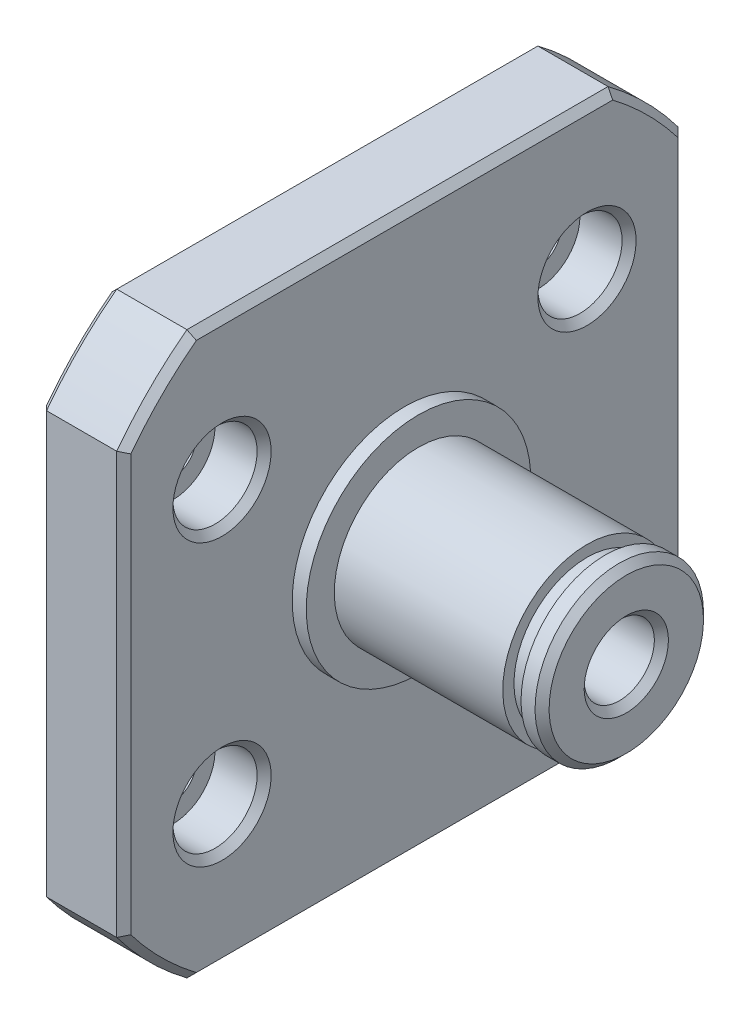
ISO-10303-21;
HEADER;
FILE_DESCRIPTION(('STEP AP214'),'2;1');
FILE_NAME('part.step','',(''),(''),'','','');
FILE_SCHEMA(('AUTOMOTIVE_DESIGN { 1 0 10303 214 1 1 1 1 }'));
ENDSEC;
DATA;
#1=APPLICATION_CONTEXT('core data for automotive mechanical design processes');
#2=APPLICATION_PROTOCOL_DEFINITION('international standard','automotive_design',2000,#1);
#3=PRODUCT_CONTEXT('',#1,'mechanical');
#4=PRODUCT('Part','Part','',(#3));
#5=PRODUCT_RELATED_PRODUCT_CATEGORY('part','',(#4));
#6=PRODUCT_DEFINITION_FORMATION('','',#4);
#7=PRODUCT_DEFINITION_CONTEXT('part definition',#1,'design');
#8=PRODUCT_DEFINITION('design','',#6,#7);
#9=PRODUCT_DEFINITION_SHAPE('','',#8);
#10=(LENGTH_UNIT() NAMED_UNIT(*) SI_UNIT(.MILLI.,.METRE.));
#11=(NAMED_UNIT(*) PLANE_ANGLE_UNIT() SI_UNIT($,.RADIAN.));
#12=(NAMED_UNIT(*) SI_UNIT($,.STERADIAN.) SOLID_ANGLE_UNIT());
#13=UNCERTAINTY_MEASURE_WITH_UNIT(LENGTH_MEASURE(1.E-05),#10,'distance_accuracy_value','');
#14=(GEOMETRIC_REPRESENTATION_CONTEXT(3) GLOBAL_UNCERTAINTY_ASSIGNED_CONTEXT((#13)) GLOBAL_UNIT_ASSIGNED_CONTEXT((#10,
#11,#12)) REPRESENTATION_CONTEXT('',''));
#15=CARTESIAN_POINT('',(0.,0.,0.));
#16=DIRECTION('',(0.,0.,1.));
#17=DIRECTION('',(1.,0.,0.));
#18=AXIS2_PLACEMENT_3D('',#15,#16,#17);
#19=CARTESIAN_POINT('',(16.8,2.5,0.));
#20=DIRECTION('',(1.,0.,0.));
#21=DIRECTION('',(0.,1.,0.));
#22=AXIS2_PLACEMENT_3D('',#19,#20,#21);
#23=PLANE('',#22);
#24=DIRECTION('',(0.,0.,-1.));
#25=VECTOR('',#24,1.);
#26=CARTESIAN_POINT('',(16.8,-1.5,0.));
#27=LINE('',#26,#25);
#28=CARTESIAN_POINT('',(16.8,-1.5,2.));
#29=VERTEX_POINT('',#28);
#30=CARTESIAN_POINT('',(16.8,-1.5,-2.));
#31=VERTEX_POINT('',#30);
#32=EDGE_CURVE('E261',#29,#31,#27,.T.);
#33=ORIENTED_EDGE('',*,*,#32,.F.);
#34=CARTESIAN_POINT('',(16.8,0.,0.));
#35=DIRECTION('',(1.,0.,0.));
#36=DIRECTION('',(0.,1.,0.));
#37=AXIS2_PLACEMENT_3D('',#34,#35,#36);
#38=CIRCLE('',#37,2.5);
#39=EDGE_CURVE('E610',#29,#31,#38,.T.);
#40=ORIENTED_EDGE('',*,*,#39,.T.);
#41=EDGE_LOOP('',(#33,#40));
#42=FACE_BOUND('',#41,.T.);
#43=ADVANCED_FACE('F35',(#42),#23,.T.);
#44=CARTESIAN_POINT('',(0.,0.,0.));
#45=DIRECTION('',(-1.,0.,0.));
#46=DIRECTION('',(0.,-1.,0.));
#47=AXIS2_PLACEMENT_3D('',#44,#45,#46);
#48=CONICAL_SURFACE('',#47,1.99999999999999,0.785398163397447);
#49=CARTESIAN_POINT('',(-1.27725972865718,-1.5,-2.91383447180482));
#50=CARTESIAN_POINT('',(-1.21724414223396,-1.5,-2.84632281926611));
#51=CARTESIAN_POINT('',(-1.15746145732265,-1.5,-2.77860211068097));
#52=CARTESIAN_POINT('',(-1.03848662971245,-1.5,-2.64263139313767));
#53=CARTESIAN_POINT('',(-0.9792945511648,-1.5,-2.57438132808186));
#54=CARTESIAN_POINT('',(-0.86138032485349,-1.5,-2.43695412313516));
#55=CARTESIAN_POINT('',(-0.802661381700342,-1.5,-2.36777422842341));
#56=CARTESIAN_POINT('',(-0.686150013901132,-1.5,-2.22864291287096));
#57=CARTESIAN_POINT('',(-0.628357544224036,-1.5,-2.15869152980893));
#58=CARTESIAN_POINT('',(-0.510593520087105,-1.5,-2.01369677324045));
#59=CARTESIAN_POINT('',(-0.450693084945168,-1.5,-1.93859546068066));
#60=CARTESIAN_POINT('',(-0.332642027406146,-1.5,-1.78703130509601));
#61=CARTESIAN_POINT('',(-0.274491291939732,-1.5,-1.71056855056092));
#62=CARTESIAN_POINT('',(-0.160664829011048,-1.5,-1.55602138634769));
#63=CARTESIAN_POINT('',(-0.104984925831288,-1.5,-1.47794006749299));
#64=CARTESIAN_POINT('',(0.00305633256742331,-1.5,-1.31952631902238));
#65=CARTESIAN_POINT('',(0.0554188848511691,-1.5,-1.2391947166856));
#66=CARTESIAN_POINT('',(0.140124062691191,-1.5,-1.10052560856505));
#67=CARTESIAN_POINT('',(0.173703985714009,-1.5,-1.04294766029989));
#68=CARTESIAN_POINT('',(0.237830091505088,-1.5,-0.926084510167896));
#69=CARTESIAN_POINT('',(0.268375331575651,-1.5,-0.866798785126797));
#70=CARTESIAN_POINT('',(0.325204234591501,-1.5,-0.746799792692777));
#71=CARTESIAN_POINT('',(0.351521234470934,-1.5,-0.686102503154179));
#72=CARTESIAN_POINT('',(0.398940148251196,-1.5,-0.56269741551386));
#73=CARTESIAN_POINT('',(0.420045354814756,-1.5,-0.49999091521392));
#74=CARTESIAN_POINT('',(0.450001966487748,-1.5,-0.392743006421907));
#75=CARTESIAN_POINT('',(0.460619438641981,-1.5,-0.348695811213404));
#76=CARTESIAN_POINT('',(0.478272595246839,-1.5,-0.259894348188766));
#77=CARTESIAN_POINT('',(0.485309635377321,-1.5,-0.215140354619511));
#78=CARTESIAN_POINT('',(0.495435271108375,-1.5,-0.125302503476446));
#79=CARTESIAN_POINT('',(0.498534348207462,-1.5,-0.0802198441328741));
#80=CARTESIAN_POINT('',(0.500644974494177,-1.5,0.0100433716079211));
#81=CARTESIAN_POINT('',(0.499656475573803,-1.5,0.0552239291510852));
#82=CARTESIAN_POINT('',(0.49365425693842,-1.5,0.145226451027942));
#83=CARTESIAN_POINT('',(0.488648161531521,-1.5,0.190048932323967));
#84=CARTESIAN_POINT('',(0.474887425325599,-1.5,0.279116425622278));
#85=CARTESIAN_POINT('',(0.466131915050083,-1.5,0.323361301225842));
#86=CARTESIAN_POINT('',(0.445244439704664,-1.5,0.411210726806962));
#87=CARTESIAN_POINT('',(0.43310004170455,-1.5,0.454812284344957));
#88=CARTESIAN_POINT('',(0.405915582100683,-1.5,0.541090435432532));
#89=CARTESIAN_POINT('',(0.390875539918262,-1.5,0.583767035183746));
#90=CARTESIAN_POINT('',(0.332045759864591,-1.5,0.736564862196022));
#91=CARTESIAN_POINT('',(0.281152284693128,-1.5,0.843947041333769));
#92=CARTESIAN_POINT('',(0.169246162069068,-1.5,1.05333291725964));
#93=CARTESIAN_POINT('',(0.108209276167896,-1.5,1.15532294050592));
#94=CARTESIAN_POINT('',(-0.0210353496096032,-1.5,1.35668988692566));
#95=CARTESIAN_POINT('',(-0.0893335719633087,-1.5,1.4560081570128));
#96=CARTESIAN_POINT('',(-0.194847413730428,-1.5,1.60265082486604));
#97=CARTESIAN_POINT('',(-0.230508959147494,-1.5,1.6511161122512));
#98=CARTESIAN_POINT('',(-0.302692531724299,-1.5,1.74740058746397));
#99=CARTESIAN_POINT('',(-0.339214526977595,-1.5,1.79521979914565));
#100=CARTESIAN_POINT('',(-0.464041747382,-1.5,1.95618427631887));
#101=CARTESIAN_POINT('',(-0.553990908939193,-1.5,2.06805306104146));
#102=CARTESIAN_POINT('',(-0.736513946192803,-1.5,2.28963458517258));
#103=CARTESIAN_POINT('',(-0.829088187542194,-1.5,2.39934702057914));
#104=CARTESIAN_POINT('',(-1.01609849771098,-1.5,2.61724618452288));
#105=CARTESIAN_POINT('',(-1.11053529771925,-1.5,2.72543228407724));
#106=CARTESIAN_POINT('',(-1.30073159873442,-1.5,2.9406371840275));
#107=CARTESIAN_POINT('',(-1.39649113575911,-1.5,3.04765595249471));
#108=CARTESIAN_POINT('',(-1.68560492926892,-1.5,3.3678160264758));
#109=CARTESIAN_POINT('',(-1.88042271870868,-1.5,3.57963413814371));
#110=CARTESIAN_POINT('',(-2.27231008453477,-1.5,4.00106848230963));
#111=CARTESIAN_POINT('',(-2.46937910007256,-1.5,4.2106852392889));
#112=CARTESIAN_POINT('',(-2.84167769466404,-1.5,4.60383939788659));
#113=CARTESIAN_POINT('',(-3.01674010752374,-1.5,4.78753524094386));
#114=CARTESIAN_POINT('',(-3.36771431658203,-1.5,5.15413935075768));
#115=CARTESIAN_POINT('',(-3.54362617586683,-1.5,5.33704755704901));
#116=CARTESIAN_POINT('',(-3.89547115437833,-1.5,5.7016547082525));
#117=CARTESIAN_POINT('',(-4.07140220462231,-1.5,5.88335565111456));
#118=CARTESIAN_POINT('',(-4.42372222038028,-1.5,6.24628302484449));
#119=CARTESIAN_POINT('',(-4.60011114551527,-1.5,6.42750949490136));
#120=CARTESIAN_POINT('',(-4.77666754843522,-1.5,6.60857193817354));
#121=B_SPLINE_CURVE_WITH_KNOTS('',3,(#49,#50,#51,#52,#53,#54,#55,#56,#57,#58,#59,#60,#61,#62,
#63,#64,#65,#66,#67,#68,#69,#70,#71,#72,#73,#74,#75,#76,#77,#78,#79,#80,#81,#82,#83,#84,#85,#86,
#87,#88,#89,#90,#91,#92,#93,#94,#95,#96,#97,#98,#99,#100,#101,#102,#103,#104,#105,#106,#107,
#108,#109,#110,#111,#112,#113,#114,#115,#116,#117,#118,#119,#120),.UNSPECIFIED.,.F.,.F.,(4,2,2,
2,2,2,2,2,2,2,2,2,2,2,2,2,2,2,2,2,2,2,2,2,2,2,2,2,2,2,2,2,2,2,2,4),(0.,0.270994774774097,
0.542018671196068,0.814232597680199,1.08643325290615,1.3746059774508,1.66276003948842,
1.95040697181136,2.23794950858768,2.43784579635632,2.63780398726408,2.83609879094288,
3.03426799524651,3.17006813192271,3.30581681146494,3.44120341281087,3.57659160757,
3.71172347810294,3.84688670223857,3.98255247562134,4.11821733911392,4.47365712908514,
4.82995881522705,5.19138326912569,5.37189350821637,5.55239706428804,5.98296540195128,
6.41359401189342,6.84439517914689,7.27520810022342,8.13853180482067,9.00164492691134,
9.76290262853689,10.5242177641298,11.2829675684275,12.0416525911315),.UNSPECIFIED.);
#122=CARTESIAN_POINT('',(0.,-1.5,-1.32287565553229));
#123=VERTEX_POINT('',#122);
#124=CARTESIAN_POINT('',(0.,-1.5,1.32287565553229));
#125=VERTEX_POINT('',#124);
#126=EDGE_CURVE('E256',#123,#125,#121,.T.);
#127=ORIENTED_EDGE('',*,*,#126,.F.);
#128=CARTESIAN_POINT('',(0.,0.,0.));
#129=DIRECTION('',(-1.,0.,0.));
#130=DIRECTION('',(0.,-1.,0.));
#131=AXIS2_PLACEMENT_3D('',#128,#129,#130);
#132=CIRCLE('',#131,1.99999999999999);
#133=EDGE_CURVE('E301',#125,#123,#132,.F.);
#134=ORIENTED_EDGE('',*,*,#133,.F.);
#135=EDGE_LOOP('',(#127,#134));
#136=FACE_BOUND('',#135,.T.);
#137=ADVANCED_FACE('F251',(#136),#48,.F.);
#138=CARTESIAN_POINT('',(0.,-10.,-13.));
#139=DIRECTION('',(1.,0.,0.));
#140=DIRECTION('',(0.,1.,0.));
#141=AXIS2_PLACEMENT_3D('',#138,#139,#140);
#142=CYLINDRICAL_SURFACE('',#141,1.65);
#143=CARTESIAN_POINT('',(0.499999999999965,-10.,-13.));
#144=DIRECTION('',(-1.,0.,0.));
#145=DIRECTION('',(0.,0.,1.));
#146=AXIS2_PLACEMENT_3D('',#143,#144,#145);
#147=CIRCLE('',#146,1.65);
#148=CARTESIAN_POINT('',(0.499999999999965,-8.35,-13.));
#149=VERTEX_POINT('',#148);
#150=EDGE_CURVE('E300',#149,#149,#147,.T.);
#151=CARTESIAN_POINT('',(2.5,-10.,-13.));
#152=DIRECTION('',(1.,0.,0.));
#153=DIRECTION('',(0.,1.,0.));
#154=AXIS2_PLACEMENT_3D('',#151,#152,#153);
#155=CIRCLE('',#154,1.65);
#156=CARTESIAN_POINT('',(2.5,-8.35,-13.));
#157=VERTEX_POINT('',#156);
#158=EDGE_CURVE('E602',#157,#157,#155,.F.);
#159=CARTESIAN_POINT('',(0.499999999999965,-8.35,-13.));
#160=CARTESIAN_POINT('',(0.520833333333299,-8.35,-13.));
#161=CARTESIAN_POINT('',(0.541666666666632,-8.35,-13.));
#162=CARTESIAN_POINT('',(0.5833333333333,-8.35,-13.));
#163=CARTESIAN_POINT('',(0.604166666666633,-8.35,-13.));
#164=CARTESIAN_POINT('',(0.645833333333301,-8.35,-13.));
#165=CARTESIAN_POINT('',(0.666666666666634,-8.35,-13.));
#166=CARTESIAN_POINT('',(0.708333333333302,-8.35,-13.));
#167=CARTESIAN_POINT('',(0.729166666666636,-8.35,-13.));
#168=CARTESIAN_POINT('',(0.770833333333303,-8.35,-13.));
#169=CARTESIAN_POINT('',(0.791666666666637,-8.35,-13.));
#170=CARTESIAN_POINT('',(0.833333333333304,-8.35,-13.));
#171=CARTESIAN_POINT('',(0.854166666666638,-8.35,-13.));
#172=CARTESIAN_POINT('',(0.895833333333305,-8.35,-13.));
#173=CARTESIAN_POINT('',(0.916666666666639,-8.35,-13.));
#174=CARTESIAN_POINT('',(0.958333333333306,-8.35,-13.));
#175=CARTESIAN_POINT('',(0.97916666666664,-8.35,-13.));
#176=CARTESIAN_POINT('',(1.02083333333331,-8.35,-13.));
#177=CARTESIAN_POINT('',(1.04166666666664,-8.35,-13.));
#178=CARTESIAN_POINT('',(1.08333333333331,-8.35,-13.));
#179=CARTESIAN_POINT('',(1.10416666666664,-8.35,-13.));
#180=CARTESIAN_POINT('',(1.14583333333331,-8.35,-13.));
#181=CARTESIAN_POINT('',(1.16666666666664,-8.35,-13.));
#182=CARTESIAN_POINT('',(1.20833333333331,-8.35,-13.));
#183=CARTESIAN_POINT('',(1.22916666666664,-8.35,-13.));
#184=CARTESIAN_POINT('',(1.27083333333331,-8.35,-13.));
#185=CARTESIAN_POINT('',(1.29166666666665,-8.35,-13.));
#186=CARTESIAN_POINT('',(1.33333333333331,-8.35,-13.));
#187=CARTESIAN_POINT('',(1.35416666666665,-8.35,-13.));
#188=CARTESIAN_POINT('',(1.39583333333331,-8.35,-13.));
#189=CARTESIAN_POINT('',(1.41666666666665,-8.35,-13.));
#190=CARTESIAN_POINT('',(1.45833333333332,-8.35,-13.));
#191=CARTESIAN_POINT('',(1.47916666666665,-8.35,-13.));
#192=CARTESIAN_POINT('',(1.52083333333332,-8.35,-13.));
#193=CARTESIAN_POINT('',(1.54166666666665,-8.35,-13.));
#194=CARTESIAN_POINT('',(1.58333333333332,-8.35,-13.));
#195=CARTESIAN_POINT('',(1.60416666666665,-8.35,-13.));
#196=CARTESIAN_POINT('',(1.64583333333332,-8.35,-13.));
#197=CARTESIAN_POINT('',(1.66666666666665,-8.35,-13.));
#198=CARTESIAN_POINT('',(1.70833333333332,-8.35,-13.));
#199=CARTESIAN_POINT('',(1.72916666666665,-8.35,-13.));
#200=CARTESIAN_POINT('',(1.77083333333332,-8.35,-13.));
#201=CARTESIAN_POINT('',(1.79166666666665,-8.35,-13.));
#202=CARTESIAN_POINT('',(1.83333333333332,-8.35,-13.));
#203=CARTESIAN_POINT('',(1.85416666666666,-8.35,-13.));
#204=CARTESIAN_POINT('',(1.89583333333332,-8.35,-13.));
#205=CARTESIAN_POINT('',(1.91666666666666,-8.35,-13.));
#206=CARTESIAN_POINT('',(1.95833333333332,-8.35,-13.));
#207=CARTESIAN_POINT('',(1.97916666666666,-8.35,-13.));
#208=CARTESIAN_POINT('',(2.02083333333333,-8.35,-13.));
#209=CARTESIAN_POINT('',(2.04166666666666,-8.35,-13.));
#210=CARTESIAN_POINT('',(2.08333333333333,-8.35,-13.));
#211=CARTESIAN_POINT('',(2.10416666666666,-8.35,-13.));
#212=CARTESIAN_POINT('',(2.14583333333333,-8.35,-13.));
#213=CARTESIAN_POINT('',(2.16666666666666,-8.35,-13.));
#214=CARTESIAN_POINT('',(2.20833333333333,-8.35,-13.));
#215=CARTESIAN_POINT('',(2.22916666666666,-8.35,-13.));
#216=CARTESIAN_POINT('',(2.27083333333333,-8.35,-13.));
#217=CARTESIAN_POINT('',(2.29166666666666,-8.35,-13.));
#218=CARTESIAN_POINT('',(2.33333333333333,-8.35,-13.));
#219=CARTESIAN_POINT('',(2.35416666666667,-8.35,-13.));
#220=CARTESIAN_POINT('',(2.39583333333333,-8.35,-13.));
#221=CARTESIAN_POINT('',(2.41666666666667,-8.35,-13.));
#222=CARTESIAN_POINT('',(2.45833333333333,-8.35,-13.));
#223=CARTESIAN_POINT('',(2.47916666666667,-8.35,-13.));
#224=CARTESIAN_POINT('',(2.5,-8.35,-13.));
#225=B_SPLINE_CURVE_WITH_KNOTS('',3,(#159,#160,#161,#162,#163,#164,#165,#166,#167,#168,#169,
#170,#171,#172,#173,#174,#175,#176,#177,#178,#179,#180,#181,#182,#183,#184,#185,#186,#187,#188,
#189,#190,#191,#192,#193,#194,#195,#196,#197,#198,#199,#200,#201,#202,#203,#204,#205,#206,#207,
#208,#209,#210,#211,#212,#213,#214,#215,#216,#217,#218,#219,#220,#221,#222,#223,#224),
.UNSPECIFIED.,.F.,.F.,(4,2,2,2,2,2,2,2,2,2,2,2,2,2,2,2,2,2,2,2,2,2,2,2,2,2,2,2,2,2,2,2,4),(0.,
0.0625000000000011,0.125000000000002,0.187500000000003,0.250000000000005,0.312500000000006,
0.375000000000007,0.437500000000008,0.500000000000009,0.56250000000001,0.625000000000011,
0.687500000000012,0.750000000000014,0.812500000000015,0.875000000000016,0.937500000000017,
1.00000000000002,1.06250000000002,1.12500000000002,1.18750000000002,1.25000000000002,
1.31250000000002,1.37500000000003,1.43750000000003,1.50000000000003,1.56250000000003,
1.62500000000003,1.68750000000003,1.75000000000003,1.81250000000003,1.87500000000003,
1.93750000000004,2.00000000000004),.UNSPECIFIED.);
#226=EDGE_CURVE('BSEAM282',#149,#157,#225,.T.);
#227=ORIENTED_EDGE('',*,*,#150,.T.);
#228=ORIENTED_EDGE('',*,*,#158,.F.);
#229=ORIENTED_EDGE('',*,*,#226,.T.);
#230=ORIENTED_EDGE('',*,*,#226,.F.);
#231=EDGE_LOOP('',(#227,#229,#228,#230));
#232=FACE_BOUND('',#231,.T.);
#233=ADVANCED_FACE('F282',(#232),#142,.F.);
#234=CARTESIAN_POINT('',(0.,-10.,13.));
#235=DIRECTION('',(1.,0.,0.));
#236=DIRECTION('',(0.,1.,0.));
#237=AXIS2_PLACEMENT_3D('',#234,#235,#236);
#238=CYLINDRICAL_SURFACE('',#237,1.65);
#239=CARTESIAN_POINT('',(0.499999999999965,-10.,13.));
#240=DIRECTION('',(-1.,0.,0.));
#241=DIRECTION('',(0.,0.,1.));
#242=AXIS2_PLACEMENT_3D('',#239,#240,#241);
#243=CIRCLE('',#242,1.65);
#244=CARTESIAN_POINT('',(0.499999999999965,-8.35,13.));
#245=VERTEX_POINT('',#244);
#246=EDGE_CURVE('E304',#245,#245,#243,.T.);
#247=CARTESIAN_POINT('',(2.5,-10.,13.));
#248=DIRECTION('',(1.,0.,0.));
#249=DIRECTION('',(0.,1.,0.));
#250=AXIS2_PLACEMENT_3D('',#247,#248,#249);
#251=CIRCLE('',#250,1.65);
#252=CARTESIAN_POINT('',(2.5,-8.35,13.));
#253=VERTEX_POINT('',#252);
#254=EDGE_CURVE('E641',#253,#253,#251,.F.);
#255=CARTESIAN_POINT('',(0.499999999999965,-8.35,13.));
#256=CARTESIAN_POINT('',(0.520833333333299,-8.35,13.));
#257=CARTESIAN_POINT('',(0.541666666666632,-8.35,13.));
#258=CARTESIAN_POINT('',(0.5833333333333,-8.35,13.));
#259=CARTESIAN_POINT('',(0.604166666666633,-8.35,13.));
#260=CARTESIAN_POINT('',(0.645833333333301,-8.35,13.));
#261=CARTESIAN_POINT('',(0.666666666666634,-8.35,13.));
#262=CARTESIAN_POINT('',(0.708333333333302,-8.35,13.));
#263=CARTESIAN_POINT('',(0.729166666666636,-8.35,13.));
#264=CARTESIAN_POINT('',(0.770833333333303,-8.35,13.));
#265=CARTESIAN_POINT('',(0.791666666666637,-8.35,13.));
#266=CARTESIAN_POINT('',(0.833333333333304,-8.35,13.));
#267=CARTESIAN_POINT('',(0.854166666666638,-8.35,13.));
#268=CARTESIAN_POINT('',(0.895833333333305,-8.35,13.));
#269=CARTESIAN_POINT('',(0.916666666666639,-8.35,13.));
#270=CARTESIAN_POINT('',(0.958333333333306,-8.35,13.));
#271=CARTESIAN_POINT('',(0.97916666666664,-8.35,13.));
#272=CARTESIAN_POINT('',(1.02083333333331,-8.35,13.));
#273=CARTESIAN_POINT('',(1.04166666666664,-8.35,13.));
#274=CARTESIAN_POINT('',(1.08333333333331,-8.35,13.));
#275=CARTESIAN_POINT('',(1.10416666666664,-8.35,13.));
#276=CARTESIAN_POINT('',(1.14583333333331,-8.35,13.));
#277=CARTESIAN_POINT('',(1.16666666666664,-8.35,13.));
#278=CARTESIAN_POINT('',(1.20833333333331,-8.35,13.));
#279=CARTESIAN_POINT('',(1.22916666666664,-8.35,13.));
#280=CARTESIAN_POINT('',(1.27083333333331,-8.35,13.));
#281=CARTESIAN_POINT('',(1.29166666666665,-8.35,13.));
#282=CARTESIAN_POINT('',(1.33333333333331,-8.35,13.));
#283=CARTESIAN_POINT('',(1.35416666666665,-8.35,13.));
#284=CARTESIAN_POINT('',(1.39583333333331,-8.35,13.));
#285=CARTESIAN_POINT('',(1.41666666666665,-8.35,13.));
#286=CARTESIAN_POINT('',(1.45833333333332,-8.35,13.));
#287=CARTESIAN_POINT('',(1.47916666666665,-8.35,13.));
#288=CARTESIAN_POINT('',(1.52083333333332,-8.35,13.));
#289=CARTESIAN_POINT('',(1.54166666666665,-8.35,13.));
#290=CARTESIAN_POINT('',(1.58333333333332,-8.35,13.));
#291=CARTESIAN_POINT('',(1.60416666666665,-8.35,13.));
#292=CARTESIAN_POINT('',(1.64583333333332,-8.35,13.));
#293=CARTESIAN_POINT('',(1.66666666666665,-8.35,13.));
#294=CARTESIAN_POINT('',(1.70833333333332,-8.35,13.));
#295=CARTESIAN_POINT('',(1.72916666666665,-8.35,13.));
#296=CARTESIAN_POINT('',(1.77083333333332,-8.35,13.));
#297=CARTESIAN_POINT('',(1.79166666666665,-8.35,13.));
#298=CARTESIAN_POINT('',(1.83333333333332,-8.35,13.));
#299=CARTESIAN_POINT('',(1.85416666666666,-8.35,13.));
#300=CARTESIAN_POINT('',(1.89583333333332,-8.35,13.));
#301=CARTESIAN_POINT('',(1.91666666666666,-8.35,13.));
#302=CARTESIAN_POINT('',(1.95833333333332,-8.35,13.));
#303=CARTESIAN_POINT('',(1.97916666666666,-8.35,13.));
#304=CARTESIAN_POINT('',(2.02083333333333,-8.35,13.));
#305=CARTESIAN_POINT('',(2.04166666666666,-8.35,13.));
#306=CARTESIAN_POINT('',(2.08333333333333,-8.35,13.));
#307=CARTESIAN_POINT('',(2.10416666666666,-8.35,13.));
#308=CARTESIAN_POINT('',(2.14583333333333,-8.35,13.));
#309=CARTESIAN_POINT('',(2.16666666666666,-8.35,13.));
#310=CARTESIAN_POINT('',(2.20833333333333,-8.35,13.));
#311=CARTESIAN_POINT('',(2.22916666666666,-8.35,13.));
#312=CARTESIAN_POINT('',(2.27083333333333,-8.35,13.));
#313=CARTESIAN_POINT('',(2.29166666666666,-8.35,13.));
#314=CARTESIAN_POINT('',(2.33333333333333,-8.35,13.));
#315=CARTESIAN_POINT('',(2.35416666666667,-8.35,13.));
#316=CARTESIAN_POINT('',(2.39583333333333,-8.35,13.));
#317=CARTESIAN_POINT('',(2.41666666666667,-8.35,13.));
#318=CARTESIAN_POINT('',(2.45833333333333,-8.35,13.));
#319=CARTESIAN_POINT('',(2.47916666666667,-8.35,13.));
#320=CARTESIAN_POINT('',(2.5,-8.35,13.));
#321=B_SPLINE_CURVE_WITH_KNOTS('',3,(#255,#256,#257,#258,#259,#260,#261,#262,#263,#264,#265,
#266,#267,#268,#269,#270,#271,#272,#273,#274,#275,#276,#277,#278,#279,#280,#281,#282,#283,#284,
#285,#286,#287,#288,#289,#290,#291,#292,#293,#294,#295,#296,#297,#298,#299,#300,#301,#302,#303,
#304,#305,#306,#307,#308,#309,#310,#311,#312,#313,#314,#315,#316,#317,#318,#319,#320),
.UNSPECIFIED.,.F.,.F.,(4,2,2,2,2,2,2,2,2,2,2,2,2,2,2,2,2,2,2,2,2,2,2,2,2,2,2,2,2,2,2,2,4),(0.,
0.0625000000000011,0.125000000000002,0.187500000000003,0.250000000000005,0.312500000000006,
0.375000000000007,0.437500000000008,0.500000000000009,0.56250000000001,0.625000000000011,
0.687500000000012,0.750000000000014,0.812500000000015,0.875000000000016,0.937500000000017,
1.00000000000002,1.06250000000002,1.12500000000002,1.18750000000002,1.25000000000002,
1.31250000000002,1.37500000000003,1.43750000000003,1.50000000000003,1.56250000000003,
1.62500000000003,1.68750000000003,1.75000000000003,1.81250000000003,1.87500000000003,
1.93750000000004,2.00000000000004),.UNSPECIFIED.);
#322=EDGE_CURVE('BSEAM686',#245,#253,#321,.T.);
#323=ORIENTED_EDGE('',*,*,#246,.T.);
#324=ORIENTED_EDGE('',*,*,#254,.F.);
#325=ORIENTED_EDGE('',*,*,#322,.T.);
#326=ORIENTED_EDGE('',*,*,#322,.F.);
#327=EDGE_LOOP('',(#323,#325,#324,#326));
#328=FACE_BOUND('',#327,.T.);
#329=ADVANCED_FACE('F686',(#328),#238,.F.);
#330=CARTESIAN_POINT('',(0.,10.,13.));
#331=DIRECTION('',(1.,0.,0.));
#332=DIRECTION('',(0.,1.,0.));
#333=AXIS2_PLACEMENT_3D('',#330,#331,#332);
#334=CYLINDRICAL_SURFACE('',#333,1.65);
#335=CARTESIAN_POINT('',(0.499999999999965,10.,13.));
#336=DIRECTION('',(-1.,0.,0.));
#337=DIRECTION('',(0.,0.,1.));
#338=AXIS2_PLACEMENT_3D('',#335,#336,#337);
#339=CIRCLE('',#338,1.65);
#340=CARTESIAN_POINT('',(0.499999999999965,11.65,13.));
#341=VERTEX_POINT('',#340);
#342=EDGE_CURVE('E312',#341,#341,#339,.T.);
#343=CARTESIAN_POINT('',(2.5,10.,13.));
#344=DIRECTION('',(1.,0.,0.));
#345=DIRECTION('',(0.,1.,0.));
#346=AXIS2_PLACEMENT_3D('',#343,#344,#345);
#347=CIRCLE('',#346,1.65);
#348=CARTESIAN_POINT('',(2.5,11.65,13.));
#349=VERTEX_POINT('',#348);
#350=EDGE_CURVE('E637',#349,#349,#347,.F.);
#351=CARTESIAN_POINT('',(0.499999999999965,11.65,13.));
#352=CARTESIAN_POINT('',(0.520833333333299,11.65,13.));
#353=CARTESIAN_POINT('',(0.541666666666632,11.65,13.));
#354=CARTESIAN_POINT('',(0.5833333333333,11.65,13.));
#355=CARTESIAN_POINT('',(0.604166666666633,11.65,13.));
#356=CARTESIAN_POINT('',(0.645833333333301,11.65,13.));
#357=CARTESIAN_POINT('',(0.666666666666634,11.65,13.));
#358=CARTESIAN_POINT('',(0.708333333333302,11.65,13.));
#359=CARTESIAN_POINT('',(0.729166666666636,11.65,13.));
#360=CARTESIAN_POINT('',(0.770833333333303,11.65,13.));
#361=CARTESIAN_POINT('',(0.791666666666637,11.65,13.));
#362=CARTESIAN_POINT('',(0.833333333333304,11.65,13.));
#363=CARTESIAN_POINT('',(0.854166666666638,11.65,13.));
#364=CARTESIAN_POINT('',(0.895833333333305,11.65,13.));
#365=CARTESIAN_POINT('',(0.916666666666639,11.65,13.));
#366=CARTESIAN_POINT('',(0.958333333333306,11.65,13.));
#367=CARTESIAN_POINT('',(0.97916666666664,11.65,13.));
#368=CARTESIAN_POINT('',(1.02083333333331,11.65,13.));
#369=CARTESIAN_POINT('',(1.04166666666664,11.65,13.));
#370=CARTESIAN_POINT('',(1.08333333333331,11.65,13.));
#371=CARTESIAN_POINT('',(1.10416666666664,11.65,13.));
#372=CARTESIAN_POINT('',(1.14583333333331,11.65,13.));
#373=CARTESIAN_POINT('',(1.16666666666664,11.65,13.));
#374=CARTESIAN_POINT('',(1.20833333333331,11.65,13.));
#375=CARTESIAN_POINT('',(1.22916666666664,11.65,13.));
#376=CARTESIAN_POINT('',(1.27083333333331,11.65,13.));
#377=CARTESIAN_POINT('',(1.29166666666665,11.65,13.));
#378=CARTESIAN_POINT('',(1.33333333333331,11.65,13.));
#379=CARTESIAN_POINT('',(1.35416666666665,11.65,13.));
#380=CARTESIAN_POINT('',(1.39583333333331,11.65,13.));
#381=CARTESIAN_POINT('',(1.41666666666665,11.65,13.));
#382=CARTESIAN_POINT('',(1.45833333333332,11.65,13.));
#383=CARTESIAN_POINT('',(1.47916666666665,11.65,13.));
#384=CARTESIAN_POINT('',(1.52083333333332,11.65,13.));
#385=CARTESIAN_POINT('',(1.54166666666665,11.65,13.));
#386=CARTESIAN_POINT('',(1.58333333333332,11.65,13.));
#387=CARTESIAN_POINT('',(1.60416666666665,11.65,13.));
#388=CARTESIAN_POINT('',(1.64583333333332,11.65,13.));
#389=CARTESIAN_POINT('',(1.66666666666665,11.65,13.));
#390=CARTESIAN_POINT('',(1.70833333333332,11.65,13.));
#391=CARTESIAN_POINT('',(1.72916666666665,11.65,13.));
#392=CARTESIAN_POINT('',(1.77083333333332,11.65,13.));
#393=CARTESIAN_POINT('',(1.79166666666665,11.65,13.));
#394=CARTESIAN_POINT('',(1.83333333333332,11.65,13.));
#395=CARTESIAN_POINT('',(1.85416666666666,11.65,13.));
#396=CARTESIAN_POINT('',(1.89583333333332,11.65,13.));
#397=CARTESIAN_POINT('',(1.91666666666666,11.65,13.));
#398=CARTESIAN_POINT('',(1.95833333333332,11.65,13.));
#399=CARTESIAN_POINT('',(1.97916666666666,11.65,13.));
#400=CARTESIAN_POINT('',(2.02083333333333,11.65,13.));
#401=CARTESIAN_POINT('',(2.04166666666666,11.65,13.));
#402=CARTESIAN_POINT('',(2.08333333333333,11.65,13.));
#403=CARTESIAN_POINT('',(2.10416666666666,11.65,13.));
#404=CARTESIAN_POINT('',(2.14583333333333,11.65,13.));
#405=CARTESIAN_POINT('',(2.16666666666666,11.65,13.));
#406=CARTESIAN_POINT('',(2.20833333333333,11.65,13.));
#407=CARTESIAN_POINT('',(2.22916666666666,11.65,13.));
#408=CARTESIAN_POINT('',(2.27083333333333,11.65,13.));
#409=CARTESIAN_POINT('',(2.29166666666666,11.65,13.));
#410=CARTESIAN_POINT('',(2.33333333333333,11.65,13.));
#411=CARTESIAN_POINT('',(2.35416666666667,11.65,13.));
#412=CARTESIAN_POINT('',(2.39583333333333,11.65,13.));
#413=CARTESIAN_POINT('',(2.41666666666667,11.65,13.));
#414=CARTESIAN_POINT('',(2.45833333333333,11.65,13.));
#415=CARTESIAN_POINT('',(2.47916666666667,11.65,13.));
#416=CARTESIAN_POINT('',(2.5,11.65,13.));
#417=B_SPLINE_CURVE_WITH_KNOTS('',3,(#351,#352,#353,#354,#355,#356,#357,#358,#359,#360,#361,
#362,#363,#364,#365,#366,#367,#368,#369,#370,#371,#372,#373,#374,#375,#376,#377,#378,#379,#380,
#381,#382,#383,#384,#385,#386,#387,#388,#389,#390,#391,#392,#393,#394,#395,#396,#397,#398,#399,
#400,#401,#402,#403,#404,#405,#406,#407,#408,#409,#410,#411,#412,#413,#414,#415,#416),
.UNSPECIFIED.,.F.,.F.,(4,2,2,2,2,2,2,2,2,2,2,2,2,2,2,2,2,2,2,2,2,2,2,2,2,2,2,2,2,2,2,2,4),(0.,
0.0625000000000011,0.125000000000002,0.187500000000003,0.250000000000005,0.312500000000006,
0.375000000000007,0.437500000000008,0.500000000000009,0.56250000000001,0.625000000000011,
0.687500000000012,0.750000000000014,0.812500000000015,0.875000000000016,0.937500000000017,
1.00000000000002,1.06250000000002,1.12500000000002,1.18750000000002,1.25000000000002,
1.31250000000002,1.37500000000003,1.43750000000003,1.50000000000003,1.56250000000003,
1.62500000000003,1.68750000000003,1.75000000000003,1.81250000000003,1.87500000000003,
1.93750000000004,2.00000000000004),.UNSPECIFIED.);
#418=EDGE_CURVE('BSEAM733',#341,#349,#417,.T.);
#419=ORIENTED_EDGE('',*,*,#342,.T.);
#420=ORIENTED_EDGE('',*,*,#350,.F.);
#421=ORIENTED_EDGE('',*,*,#418,.T.);
#422=ORIENTED_EDGE('',*,*,#418,.F.);
#423=EDGE_LOOP('',(#419,#421,#420,#422));
#424=FACE_BOUND('',#423,.T.);
#425=ADVANCED_FACE('F733',(#424),#334,.F.);
#426=CARTESIAN_POINT('',(0.,10.,-13.));
#427=DIRECTION('',(1.,0.,0.));
#428=DIRECTION('',(0.,1.,0.));
#429=AXIS2_PLACEMENT_3D('',#426,#427,#428);
#430=CYLINDRICAL_SURFACE('',#429,1.65);
#431=CARTESIAN_POINT('',(0.499999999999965,10.,-13.));
#432=DIRECTION('',(-1.,0.,0.));
#433=DIRECTION('',(0.,0.,1.));
#434=AXIS2_PLACEMENT_3D('',#431,#432,#433);
#435=CIRCLE('',#434,1.65);
#436=CARTESIAN_POINT('',(0.499999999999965,11.65,-13.));
#437=VERTEX_POINT('',#436);
#438=EDGE_CURVE('E315',#437,#437,#435,.T.);
#439=CARTESIAN_POINT('',(2.5,10.,-13.));
#440=DIRECTION('',(1.,0.,0.));
#441=DIRECTION('',(0.,1.,0.));
#442=AXIS2_PLACEMENT_3D('',#439,#440,#441);
#443=CIRCLE('',#442,1.65);
#444=CARTESIAN_POINT('',(2.5,11.65,-13.));
#445=VERTEX_POINT('',#444);
#446=EDGE_CURVE('E634',#445,#445,#443,.F.);
#447=CARTESIAN_POINT('',(0.499999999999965,11.65,-13.));
#448=CARTESIAN_POINT('',(0.520833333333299,11.65,-13.));
#449=CARTESIAN_POINT('',(0.541666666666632,11.65,-13.));
#450=CARTESIAN_POINT('',(0.5833333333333,11.65,-13.));
#451=CARTESIAN_POINT('',(0.604166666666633,11.65,-13.));
#452=CARTESIAN_POINT('',(0.645833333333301,11.65,-13.));
#453=CARTESIAN_POINT('',(0.666666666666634,11.65,-13.));
#454=CARTESIAN_POINT('',(0.708333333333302,11.65,-13.));
#455=CARTESIAN_POINT('',(0.729166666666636,11.65,-13.));
#456=CARTESIAN_POINT('',(0.770833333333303,11.65,-13.));
#457=CARTESIAN_POINT('',(0.791666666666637,11.65,-13.));
#458=CARTESIAN_POINT('',(0.833333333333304,11.65,-13.));
#459=CARTESIAN_POINT('',(0.854166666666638,11.65,-13.));
#460=CARTESIAN_POINT('',(0.895833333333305,11.65,-13.));
#461=CARTESIAN_POINT('',(0.916666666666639,11.65,-13.));
#462=CARTESIAN_POINT('',(0.958333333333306,11.65,-13.));
#463=CARTESIAN_POINT('',(0.97916666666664,11.65,-13.));
#464=CARTESIAN_POINT('',(1.02083333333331,11.65,-13.));
#465=CARTESIAN_POINT('',(1.04166666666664,11.65,-13.));
#466=CARTESIAN_POINT('',(1.08333333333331,11.65,-13.));
#467=CARTESIAN_POINT('',(1.10416666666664,11.65,-13.));
#468=CARTESIAN_POINT('',(1.14583333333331,11.65,-13.));
#469=CARTESIAN_POINT('',(1.16666666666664,11.65,-13.));
#470=CARTESIAN_POINT('',(1.20833333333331,11.65,-13.));
#471=CARTESIAN_POINT('',(1.22916666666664,11.65,-13.));
#472=CARTESIAN_POINT('',(1.27083333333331,11.65,-13.));
#473=CARTESIAN_POINT('',(1.29166666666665,11.65,-13.));
#474=CARTESIAN_POINT('',(1.33333333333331,11.65,-13.));
#475=CARTESIAN_POINT('',(1.35416666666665,11.65,-13.));
#476=CARTESIAN_POINT('',(1.39583333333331,11.65,-13.));
#477=CARTESIAN_POINT('',(1.41666666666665,11.65,-13.));
#478=CARTESIAN_POINT('',(1.45833333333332,11.65,-13.));
#479=CARTESIAN_POINT('',(1.47916666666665,11.65,-13.));
#480=CARTESIAN_POINT('',(1.52083333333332,11.65,-13.));
#481=CARTESIAN_POINT('',(1.54166666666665,11.65,-13.));
#482=CARTESIAN_POINT('',(1.58333333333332,11.65,-13.));
#483=CARTESIAN_POINT('',(1.60416666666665,11.65,-13.));
#484=CARTESIAN_POINT('',(1.64583333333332,11.65,-13.));
#485=CARTESIAN_POINT('',(1.66666666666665,11.65,-13.));
#486=CARTESIAN_POINT('',(1.70833333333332,11.65,-13.));
#487=CARTESIAN_POINT('',(1.72916666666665,11.65,-13.));
#488=CARTESIAN_POINT('',(1.77083333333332,11.65,-13.));
#489=CARTESIAN_POINT('',(1.79166666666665,11.65,-13.));
#490=CARTESIAN_POINT('',(1.83333333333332,11.65,-13.));
#491=CARTESIAN_POINT('',(1.85416666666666,11.65,-13.));
#492=CARTESIAN_POINT('',(1.89583333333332,11.65,-13.));
#493=CARTESIAN_POINT('',(1.91666666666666,11.65,-13.));
#494=CARTESIAN_POINT('',(1.95833333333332,11.65,-13.));
#495=CARTESIAN_POINT('',(1.97916666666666,11.65,-13.));
#496=CARTESIAN_POINT('',(2.02083333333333,11.65,-13.));
#497=CARTESIAN_POINT('',(2.04166666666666,11.65,-13.));
#498=CARTESIAN_POINT('',(2.08333333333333,11.65,-13.));
#499=CARTESIAN_POINT('',(2.10416666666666,11.65,-13.));
#500=CARTESIAN_POINT('',(2.14583333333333,11.65,-13.));
#501=CARTESIAN_POINT('',(2.16666666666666,11.65,-13.));
#502=CARTESIAN_POINT('',(2.20833333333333,11.65,-13.));
#503=CARTESIAN_POINT('',(2.22916666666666,11.65,-13.));
#504=CARTESIAN_POINT('',(2.27083333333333,11.65,-13.));
#505=CARTESIAN_POINT('',(2.29166666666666,11.65,-13.));
#506=CARTESIAN_POINT('',(2.33333333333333,11.65,-13.));
#507=CARTESIAN_POINT('',(2.35416666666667,11.65,-13.));
#508=CARTESIAN_POINT('',(2.39583333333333,11.65,-13.));
#509=CARTESIAN_POINT('',(2.41666666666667,11.65,-13.));
#510=CARTESIAN_POINT('',(2.45833333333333,11.65,-13.));
#511=CARTESIAN_POINT('',(2.47916666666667,11.65,-13.));
#512=CARTESIAN_POINT('',(2.5,11.65,-13.));
#513=B_SPLINE_CURVE_WITH_KNOTS('',3,(#447,#448,#449,#450,#451,#452,#453,#454,#455,#456,#457,
#458,#459,#460,#461,#462,#463,#464,#465,#466,#467,#468,#469,#470,#471,#472,#473,#474,#475,#476,
#477,#478,#479,#480,#481,#482,#483,#484,#485,#486,#487,#488,#489,#490,#491,#492,#493,#494,#495,
#496,#497,#498,#499,#500,#501,#502,#503,#504,#505,#506,#507,#508,#509,#510,#511,#512),
.UNSPECIFIED.,.F.,.F.,(4,2,2,2,2,2,2,2,2,2,2,2,2,2,2,2,2,2,2,2,2,2,2,2,2,2,2,2,2,2,2,2,4),(0.,
0.0625000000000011,0.125000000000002,0.187500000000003,0.250000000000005,0.312500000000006,
0.375000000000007,0.437500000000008,0.500000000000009,0.56250000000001,0.625000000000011,
0.687500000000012,0.750000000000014,0.812500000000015,0.875000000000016,0.937500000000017,
1.00000000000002,1.06250000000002,1.12500000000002,1.18750000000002,1.25000000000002,
1.31250000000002,1.37500000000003,1.43750000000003,1.50000000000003,1.56250000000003,
1.62500000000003,1.68750000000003,1.75000000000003,1.81250000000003,1.87500000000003,
1.93750000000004,2.00000000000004),.UNSPECIFIED.);
#514=EDGE_CURVE('BSEAM729',#437,#445,#513,.T.);
#515=ORIENTED_EDGE('',*,*,#438,.T.);
#516=ORIENTED_EDGE('',*,*,#446,.F.);
#517=ORIENTED_EDGE('',*,*,#514,.T.);
#518=ORIENTED_EDGE('',*,*,#514,.F.);
#519=EDGE_LOOP('',(#515,#517,#516,#518));
#520=FACE_BOUND('',#519,.T.);
#521=ADVANCED_FACE('F729',(#520),#430,.F.);
#522=CARTESIAN_POINT('',(15.7758283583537,0.,0.));
#523=DIRECTION('',(1.,0.,0.));
#524=DIRECTION('',(0.,1.,0.));
#525=AXIS2_PLACEMENT_3D('',#522,#523,#524);
#526=CYLINDRICAL_SURFACE('',#525,25.);
#527=DIRECTION('',(1.,0.,0.));
#528=VECTOR('',#527,1.);
#529=CARTESIAN_POINT('',(0.,-20.,-15.));
#530=LINE('',#529,#528);
#531=CARTESIAN_POINT('',(0.5,-20.,-15.));
#532=VERTEX_POINT('',#531);
#533=CARTESIAN_POINT('',(5.50000000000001,-20.,-15.));
#534=VERTEX_POINT('',#533);
#535=EDGE_CURVE('E594',#532,#534,#530,.T.);
#536=ORIENTED_EDGE('',*,*,#535,.F.);
#537=CARTESIAN_POINT('',(0.5,0.,0.));
#538=DIRECTION('',(-1.,0.,0.));
#539=DIRECTION('',(0.,-1.,0.));
#540=AXIS2_PLACEMENT_3D('',#537,#538,#539);
#541=CIRCLE('',#540,25.);
#542=CARTESIAN_POINT('',(0.5,-15.,-20.));
#543=VERTEX_POINT('',#542);
#544=EDGE_CURVE('E346',#532,#543,#541,.F.);
#545=ORIENTED_EDGE('',*,*,#544,.T.);
#546=DIRECTION('',(1.,0.,0.));
#547=VECTOR('',#546,1.);
#548=CARTESIAN_POINT('',(0.,-15.,-20.));
#549=LINE('',#548,#547);
#550=CARTESIAN_POINT('',(5.50000000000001,-15.,-20.));
#551=VERTEX_POINT('',#550);
#552=EDGE_CURVE('E611',#543,#551,#549,.T.);
#553=ORIENTED_EDGE('',*,*,#552,.T.);
#554=CARTESIAN_POINT('',(5.50000000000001,0.,0.));
#555=DIRECTION('',(1.,0.,0.));
#556=DIRECTION('',(0.,1.,0.));
#557=AXIS2_PLACEMENT_3D('',#554,#555,#556);
#558=CIRCLE('',#557,25.);
#559=EDGE_CURVE('E344',#551,#534,#558,.F.);
#560=ORIENTED_EDGE('',*,*,#559,.T.);
#561=EDGE_LOOP('',(#536,#545,#553,#560));
#562=FACE_BOUND('',#561,.T.);
#563=ADVANCED_FACE('F732',(#562),#526,.T.);
#564=DIRECTION('',(1.,0.,0.));
#565=VECTOR('',#564,1.);
#566=CARTESIAN_POINT('',(0.,20.,15.));
#567=LINE('',#566,#565);
#568=CARTESIAN_POINT('',(0.5,20.,15.));
#569=VERTEX_POINT('',#568);
#570=CARTESIAN_POINT('',(5.50000000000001,20.,15.));
#571=VERTEX_POINT('',#570);
#572=EDGE_CURVE('E586',#569,#571,#567,.T.);
#573=ORIENTED_EDGE('',*,*,#572,.F.);
#574=CARTESIAN_POINT('',(0.5,0.,0.));
#575=DIRECTION('',(-1.,0.,0.));
#576=DIRECTION('',(0.,-1.,0.));
#577=AXIS2_PLACEMENT_3D('',#574,#575,#576);
#578=CIRCLE('',#577,25.);
#579=CARTESIAN_POINT('',(0.5,15.,20.));
#580=VERTEX_POINT('',#579);
#581=EDGE_CURVE('E330',#569,#580,#578,.F.);
#582=ORIENTED_EDGE('',*,*,#581,.T.);
#583=DIRECTION('',(1.,0.,0.));
#584=VECTOR('',#583,1.);
#585=CARTESIAN_POINT('',(0.,15.,20.));
#586=LINE('',#585,#584);
#587=CARTESIAN_POINT('',(5.50000000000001,15.,20.));
#588=VERTEX_POINT('',#587);
#589=EDGE_CURVE('E589',#580,#588,#586,.T.);
#590=ORIENTED_EDGE('',*,*,#589,.T.);
#591=CARTESIAN_POINT('',(5.50000000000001,0.,0.));
#592=DIRECTION('',(1.,0.,0.));
#593=DIRECTION('',(0.,1.,0.));
#594=AXIS2_PLACEMENT_3D('',#591,#592,#593);
#595=CIRCLE('',#594,25.);
#596=EDGE_CURVE('E327',#588,#571,#595,.F.);
#597=ORIENTED_EDGE('',*,*,#596,.T.);
#598=EDGE_LOOP('',(#573,#582,#590,#597));
#599=FACE_BOUND('',#598,.T.);
#600=ADVANCED_FACE('F585',(#599),#526,.T.);
#601=DIRECTION('',(1.,0.,0.));
#602=VECTOR('',#601,1.);
#603=CARTESIAN_POINT('',(0.,15.,-20.));
#604=LINE('',#603,#602);
#605=CARTESIAN_POINT('',(0.5,15.,-20.));
#606=VERTEX_POINT('',#605);
#607=CARTESIAN_POINT('',(5.50000000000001,15.,-20.));
#608=VERTEX_POINT('',#607);
#609=EDGE_CURVE('E606',#606,#608,#604,.T.);
#610=ORIENTED_EDGE('',*,*,#609,.F.);
#611=CARTESIAN_POINT('',(0.5,0.,0.));
#612=DIRECTION('',(-1.,0.,0.));
#613=DIRECTION('',(0.,-1.,0.));
#614=AXIS2_PLACEMENT_3D('',#611,#612,#613);
#615=CIRCLE('',#614,25.);
#616=CARTESIAN_POINT('',(0.5,20.,-15.));
#617=VERTEX_POINT('',#616);
#618=EDGE_CURVE('E320',#606,#617,#615,.F.);
#619=ORIENTED_EDGE('',*,*,#618,.T.);
#620=DIRECTION('',(1.,0.,0.));
#621=VECTOR('',#620,1.);
#622=CARTESIAN_POINT('',(0.,20.,-15.));
#623=LINE('',#622,#621);
#624=CARTESIAN_POINT('',(5.50000000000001,20.,-15.));
#625=VERTEX_POINT('',#624);
#626=EDGE_CURVE('E592',#617,#625,#623,.T.);
#627=ORIENTED_EDGE('',*,*,#626,.T.);
#628=CARTESIAN_POINT('',(5.50000000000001,0.,0.));
#629=DIRECTION('',(1.,0.,0.));
#630=DIRECTION('',(0.,1.,0.));
#631=AXIS2_PLACEMENT_3D('',#628,#629,#630);
#632=CIRCLE('',#631,25.);
#633=EDGE_CURVE('E318',#625,#608,#632,.F.);
#634=ORIENTED_EDGE('',*,*,#633,.T.);
#635=EDGE_LOOP('',(#610,#619,#627,#634));
#636=FACE_BOUND('',#635,.T.);
#637=ADVANCED_FACE('F776',(#636),#526,.T.);
#638=DIRECTION('',(1.,0.,0.));
#639=VECTOR('',#638,1.);
#640=CARTESIAN_POINT('',(0.,-15.,20.));
#641=LINE('',#640,#639);
#642=CARTESIAN_POINT('',(0.5,-15.,20.));
#643=VERTEX_POINT('',#642);
#644=CARTESIAN_POINT('',(5.50000000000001,-15.,20.));
#645=VERTEX_POINT('',#644);
#646=EDGE_CURVE('E596',#643,#645,#641,.T.);
#647=ORIENTED_EDGE('',*,*,#646,.F.);
#648=CARTESIAN_POINT('',(0.5,0.,0.));
#649=DIRECTION('',(-1.,0.,0.));
#650=DIRECTION('',(0.,-1.,0.));
#651=AXIS2_PLACEMENT_3D('',#648,#649,#650);
#652=CIRCLE('',#651,25.);
#653=CARTESIAN_POINT('',(0.5,-20.,15.));
#654=VERTEX_POINT('',#653);
#655=EDGE_CURVE('E338',#643,#654,#652,.F.);
#656=ORIENTED_EDGE('',*,*,#655,.T.);
#657=DIRECTION('',(1.,0.,0.));
#658=VECTOR('',#657,1.);
#659=CARTESIAN_POINT('',(0.,-20.,15.));
#660=LINE('',#659,#658);
#661=CARTESIAN_POINT('',(5.50000000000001,-20.,15.));
#662=VERTEX_POINT('',#661);
#663=EDGE_CURVE('E603',#654,#662,#660,.T.);
#664=ORIENTED_EDGE('',*,*,#663,.T.);
#665=CARTESIAN_POINT('',(5.50000000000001,0.,0.));
#666=DIRECTION('',(1.,0.,0.));
#667=DIRECTION('',(0.,1.,0.));
#668=AXIS2_PLACEMENT_3D('',#665,#666,#667);
#669=CIRCLE('',#668,25.);
#670=EDGE_CURVE('E336',#662,#645,#669,.F.);
#671=ORIENTED_EDGE('',*,*,#670,.T.);
#672=EDGE_LOOP('',(#647,#656,#664,#671));
#673=FACE_BOUND('',#672,.T.);
#674=ADVANCED_FACE('F252',(#673),#526,.T.);
#675=CARTESIAN_POINT('',(6.,25.,0.));
#676=DIRECTION('',(1.,0.,0.));
#677=DIRECTION('',(0.,1.,0.));
#678=AXIS2_PLACEMENT_3D('',#675,#676,#677);
#679=PLANE('',#678);
#680=CARTESIAN_POINT('',(6.,-10.,-13.));
#681=DIRECTION('',(1.,0.,0.));
#682=DIRECTION('',(0.,1.,0.));
#683=AXIS2_PLACEMENT_3D('',#680,#681,#682);
#684=CIRCLE('',#683,3.49999999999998);
#685=CARTESIAN_POINT('',(6.,-6.50000000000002,-13.));
#686=VERTEX_POINT('',#685);
#687=EDGE_CURVE('E378',#686,#686,#684,.F.);
#688=ORIENTED_EDGE('',*,*,#687,.T.);
#689=EDGE_LOOP('',(#688));
#690=FACE_BOUND('',#689,.T.);
#691=CARTESIAN_POINT('',(6.,-10.,13.));
#692=DIRECTION('',(1.,0.,0.));
#693=DIRECTION('',(0.,1.,0.));
#694=AXIS2_PLACEMENT_3D('',#691,#692,#693);
#695=CIRCLE('',#694,3.49999999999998);
#696=CARTESIAN_POINT('',(6.,-6.50000000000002,13.));
#697=VERTEX_POINT('',#696);
#698=EDGE_CURVE('E375',#697,#697,#695,.F.);
#699=ORIENTED_EDGE('',*,*,#698,.T.);
#700=EDGE_LOOP('',(#699));
#701=FACE_BOUND('',#700,.T.);
#702=CARTESIAN_POINT('',(6.,10.,-13.));
#703=DIRECTION('',(1.,0.,0.));
#704=DIRECTION('',(0.,1.,0.));
#705=AXIS2_PLACEMENT_3D('',#702,#703,#704);
#706=CIRCLE('',#705,3.5);
#707=CARTESIAN_POINT('',(6.,13.5,-13.));
#708=VERTEX_POINT('',#707);
#709=EDGE_CURVE('E372',#708,#708,#706,.F.);
#710=ORIENTED_EDGE('',*,*,#709,.T.);
#711=EDGE_LOOP('',(#710));
#712=FACE_BOUND('',#711,.T.);
#713=CARTESIAN_POINT('',(6.,10.,13.));
#714=DIRECTION('',(1.,0.,0.));
#715=DIRECTION('',(0.,1.,0.));
#716=AXIS2_PLACEMENT_3D('',#713,#714,#715);
#717=CIRCLE('',#716,3.5);
#718=CARTESIAN_POINT('',(6.,13.5,13.));
#719=VERTEX_POINT('',#718);
#720=EDGE_CURVE('E369',#719,#719,#717,.F.);
#721=ORIENTED_EDGE('',*,*,#720,.T.);
#722=EDGE_LOOP('',(#721));
#723=FACE_BOUND('',#722,.T.);
#724=DIRECTION('',(0.,0.,1.));
#725=VECTOR('',#724,1.);
#726=CARTESIAN_POINT('',(6.,19.5,15.));
#727=LINE('',#726,#725);
#728=CARTESIAN_POINT('',(6.,19.5,-14.8323969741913));
#729=VERTEX_POINT('',#728);
#730=CARTESIAN_POINT('',(6.,19.5,14.8323969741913));
#731=VERTEX_POINT('',#730);
#732=EDGE_CURVE('E56',#729,#731,#727,.T.);
#733=ORIENTED_EDGE('',*,*,#732,.T.);
#734=CARTESIAN_POINT('',(6.,0.,0.));
#735=DIRECTION('',(1.,0.,0.));
#736=DIRECTION('',(0.,1.,0.));
#737=AXIS2_PLACEMENT_3D('',#734,#735,#736);
#738=CIRCLE('',#737,24.5);
#739=CARTESIAN_POINT('',(6.,14.8323969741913,19.5));
#740=VERTEX_POINT('',#739);
#741=EDGE_CURVE('E367',#731,#740,#738,.T.);
#742=ORIENTED_EDGE('',*,*,#741,.T.);
#743=DIRECTION('',(0.,-1.,0.));
#744=VECTOR('',#743,1.);
#745=CARTESIAN_POINT('',(6.,-15.,19.5));
#746=LINE('',#745,#744);
#747=CARTESIAN_POINT('',(6.,-14.8323969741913,19.5));
#748=VERTEX_POINT('',#747);
#749=EDGE_CURVE('E355',#740,#748,#746,.T.);
#750=ORIENTED_EDGE('',*,*,#749,.T.);
#751=CARTESIAN_POINT('',(6.,0.,0.));
#752=DIRECTION('',(1.,0.,0.));
#753=DIRECTION('',(0.,1.,0.));
#754=AXIS2_PLACEMENT_3D('',#751,#752,#753);
#755=CIRCLE('',#754,24.5);
#756=CARTESIAN_POINT('',(6.,-19.5,14.8323969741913));
#757=VERTEX_POINT('',#756);
#758=EDGE_CURVE('E357',#748,#757,#755,.T.);
#759=ORIENTED_EDGE('',*,*,#758,.T.);
#760=DIRECTION('',(0.,0.,-1.));
#761=VECTOR('',#760,1.);
#762=CARTESIAN_POINT('',(6.,-19.5,-15.));
#763=LINE('',#762,#761);
#764=CARTESIAN_POINT('',(6.,-19.5,-14.8323969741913));
#765=VERTEX_POINT('',#764);
#766=EDGE_CURVE('E359',#757,#765,#763,.T.);
#767=ORIENTED_EDGE('',*,*,#766,.T.);
#768=CARTESIAN_POINT('',(6.,0.,0.));
#769=DIRECTION('',(1.,0.,0.));
#770=DIRECTION('',(0.,1.,0.));
#771=AXIS2_PLACEMENT_3D('',#768,#769,#770);
#772=CIRCLE('',#771,24.5);
#773=CARTESIAN_POINT('',(6.,-14.8323969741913,-19.5));
#774=VERTEX_POINT('',#773);
#775=EDGE_CURVE('E361',#765,#774,#772,.T.);
#776=ORIENTED_EDGE('',*,*,#775,.T.);
#777=DIRECTION('',(0.,1.,0.));
#778=VECTOR('',#777,1.);
#779=CARTESIAN_POINT('',(6.,15.,-19.5));
#780=LINE('',#779,#778);
#781=CARTESIAN_POINT('',(6.,14.8323969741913,-19.5));
#782=VERTEX_POINT('',#781);
#783=EDGE_CURVE('E363',#774,#782,#780,.T.);
#784=ORIENTED_EDGE('',*,*,#783,.T.);
#785=CARTESIAN_POINT('',(6.,0.,0.));
#786=DIRECTION('',(1.,0.,0.));
#787=DIRECTION('',(0.,1.,0.));
#788=AXIS2_PLACEMENT_3D('',#785,#786,#787);
#789=CIRCLE('',#788,24.5);
#790=EDGE_CURVE('E61',#782,#729,#789,.T.);
#791=ORIENTED_EDGE('',*,*,#790,.T.);
#792=EDGE_LOOP('',(#733,#742,#750,#759,#767,#776,#784,#791));
#793=FACE_BOUND('',#792,.T.);
#794=CARTESIAN_POINT('',(6.,0.,0.));
#795=DIRECTION('',(1.,0.,0.));
#796=DIRECTION('',(0.,1.,0.));
#797=AXIS2_PLACEMENT_3D('',#794,#795,#796);
#798=CIRCLE('',#797,8.);
#799=CARTESIAN_POINT('',(6.,8.,0.));
#800=VERTEX_POINT('',#799);
#801=EDGE_CURVE('E630',#800,#800,#798,.T.);
#802=ORIENTED_EDGE('',*,*,#801,.F.);
#803=EDGE_LOOP('',(#802));
#804=FACE_BOUND('',#803,.T.);
#805=ADVANCED_FACE('F564',(#690,#701,#712,#723,#793,#804),#679,.T.);
#806=CARTESIAN_POINT('',(15.7758283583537,0.,0.));
#807=DIRECTION('',(1.,0.,0.));
#808=DIRECTION('',(0.,1.,0.));
#809=AXIS2_PLACEMENT_3D('',#806,#807,#808);
#810=CYLINDRICAL_SURFACE('',#809,8.);
#811=ORIENTED_EDGE('',*,*,#801,.T.);
#812=EDGE_LOOP('',(#811));
#813=FACE_BOUND('',#812,.T.);
#814=CARTESIAN_POINT('',(7.,0.,0.));
#815=DIRECTION('',(1.,0.,0.));
#816=DIRECTION('',(0.,1.,0.));
#817=AXIS2_PLACEMENT_3D('',#814,#815,#816);
#818=CIRCLE('',#817,8.);
#819=CARTESIAN_POINT('',(7.,8.,0.));
#820=VERTEX_POINT('',#819);
#821=EDGE_CURVE('E627',#820,#820,#818,.T.);
#822=ORIENTED_EDGE('',*,*,#821,.F.);
#823=EDGE_LOOP('',(#822));
#824=FACE_BOUND('',#823,.T.);
#825=ADVANCED_FACE('F837',(#813,#824),#810,.T.);
#826=CARTESIAN_POINT('',(7.,8.,0.));
#827=DIRECTION('',(1.,0.,0.));
#828=DIRECTION('',(0.,1.,0.));
#829=AXIS2_PLACEMENT_3D('',#826,#827,#828);
#830=PLANE('',#829);
#831=ORIENTED_EDGE('',*,*,#821,.T.);
#832=EDGE_LOOP('',(#831));
#833=FACE_BOUND('',#832,.T.);
#834=CARTESIAN_POINT('',(7.,0.,0.));
#835=DIRECTION('',(1.,0.,0.));
#836=DIRECTION('',(0.,1.,0.));
#837=AXIS2_PLACEMENT_3D('',#834,#835,#836);
#838=CIRCLE('',#837,6.);
#839=CARTESIAN_POINT('',(7.,6.,0.));
#840=VERTEX_POINT('',#839);
#841=EDGE_CURVE('E624',#840,#840,#838,.T.);
#842=ORIENTED_EDGE('',*,*,#841,.F.);
#843=EDGE_LOOP('',(#842));
#844=FACE_BOUND('',#843,.T.);
#845=ADVANCED_FACE('F942',(#833,#844),#830,.T.);
#846=CARTESIAN_POINT('',(15.7758283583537,0.,0.));
#847=DIRECTION('',(1.,0.,0.));
#848=DIRECTION('',(0.,1.,0.));
#849=AXIS2_PLACEMENT_3D('',#846,#847,#848);
#850=CYLINDRICAL_SURFACE('',#849,6.);
#851=ORIENTED_EDGE('',*,*,#841,.T.);
#852=EDGE_LOOP('',(#851));
#853=FACE_BOUND('',#852,.T.);
#854=CARTESIAN_POINT('',(19.,0.,0.));
#855=DIRECTION('',(1.,0.,0.));
#856=DIRECTION('',(0.,1.,0.));
#857=AXIS2_PLACEMENT_3D('',#854,#855,#856);
#858=CIRCLE('',#857,6.);
#859=CARTESIAN_POINT('',(19.,6.,0.));
#860=VERTEX_POINT('',#859);
#861=EDGE_CURVE('E621',#860,#860,#858,.T.);
#862=ORIENTED_EDGE('',*,*,#861,.F.);
#863=EDGE_LOOP('',(#862));
#864=FACE_BOUND('',#863,.T.);
#865=ADVANCED_FACE('F932',(#853,#864),#850,.T.);
#866=CARTESIAN_POINT('',(19.,6.,0.));
#867=DIRECTION('',(1.,0.,0.));
#868=DIRECTION('',(0.,1.,0.));
#869=AXIS2_PLACEMENT_3D('',#866,#867,#868);
#870=PLANE('',#869);
#871=ORIENTED_EDGE('',*,*,#861,.T.);
#872=EDGE_LOOP('',(#871));
#873=FACE_BOUND('',#872,.T.);
#874=CARTESIAN_POINT('',(19.,0.,0.));
#875=DIRECTION('',(1.,0.,0.));
#876=DIRECTION('',(0.,1.,0.));
#877=AXIS2_PLACEMENT_3D('',#874,#875,#876);
#878=CIRCLE('',#877,5.2);
#879=CARTESIAN_POINT('',(19.,5.2,0.));
#880=VERTEX_POINT('',#879);
#881=EDGE_CURVE('E618',#880,#880,#878,.T.);
#882=ORIENTED_EDGE('',*,*,#881,.F.);
#883=EDGE_LOOP('',(#882));
#884=FACE_BOUND('',#883,.T.);
#885=ADVANCED_FACE('F922',(#873,#884),#870,.T.);
#886=CARTESIAN_POINT('',(15.7758283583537,0.,0.));
#887=DIRECTION('',(1.,0.,0.));
#888=DIRECTION('',(0.,1.,0.));
#889=AXIS2_PLACEMENT_3D('',#886,#887,#888);
#890=CYLINDRICAL_SURFACE('',#889,5.2);
#891=ORIENTED_EDGE('',*,*,#881,.T.);
#892=EDGE_LOOP('',(#891));
#893=FACE_BOUND('',#892,.T.);
#894=CARTESIAN_POINT('',(20.3,0.,0.));
#895=DIRECTION('',(1.,0.,0.));
#896=DIRECTION('',(0.,1.,0.));
#897=AXIS2_PLACEMENT_3D('',#894,#895,#896);
#898=CIRCLE('',#897,5.2);
#899=CARTESIAN_POINT('',(20.3,5.2,0.));
#900=VERTEX_POINT('',#899);
#901=EDGE_CURVE('E615',#900,#900,#898,.T.);
#902=ORIENTED_EDGE('',*,*,#901,.F.);
#903=EDGE_LOOP('',(#902));
#904=FACE_BOUND('',#903,.T.);
#905=ADVANCED_FACE('F910',(#893,#904),#890,.T.);
#906=CARTESIAN_POINT('',(20.3,5.2,0.));
#907=DIRECTION('',(-1.,0.,0.));
#908=DIRECTION('',(0.,-1.,0.));
#909=AXIS2_PLACEMENT_3D('',#906,#907,#908);
#910=PLANE('',#909);
#911=ORIENTED_EDGE('',*,*,#901,.T.);
#912=EDGE_LOOP('',(#911));
#913=FACE_BOUND('',#912,.T.);
#914=CARTESIAN_POINT('',(20.3,0.,0.));
#915=DIRECTION('',(1.,0.,0.));
#916=DIRECTION('',(0.,1.,0.));
#917=AXIS2_PLACEMENT_3D('',#914,#915,#916);
#918=CIRCLE('',#917,6.);
#919=CARTESIAN_POINT('',(20.3,6.,0.));
#920=VERTEX_POINT('',#919);
#921=EDGE_CURVE('E612',#920,#920,#918,.T.);
#922=ORIENTED_EDGE('',*,*,#921,.F.);
#923=EDGE_LOOP('',(#922));
#924=FACE_BOUND('',#923,.T.);
#925=ADVANCED_FACE('F904',(#913,#924),#910,.T.);
#926=CARTESIAN_POINT('',(15.7758283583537,0.,0.));
#927=DIRECTION('',(1.,0.,0.));
#928=DIRECTION('',(0.,1.,0.));
#929=AXIS2_PLACEMENT_3D('',#926,#927,#928);
#930=CYLINDRICAL_SURFACE('',#929,6.);
#931=CARTESIAN_POINT('',(21.3,0.,0.));
#932=DIRECTION('',(1.,0.,0.));
#933=DIRECTION('',(0.,1.,0.));
#934=AXIS2_PLACEMENT_3D('',#931,#932,#933);
#935=CIRCLE('',#934,6.);
#936=CARTESIAN_POINT('',(21.3,6.,0.));
#937=VERTEX_POINT('',#936);
#938=EDGE_CURVE('E48',#937,#937,#935,.F.);
#939=ORIENTED_EDGE('',*,*,#938,.T.);
#940=EDGE_LOOP('',(#939));
#941=FACE_BOUND('',#940,.T.);
#942=ORIENTED_EDGE('',*,*,#921,.T.);
#943=EDGE_LOOP('',(#942));
#944=FACE_BOUND('',#943,.T.);
#945=ADVANCED_FACE('F909',(#941,#944),#930,.T.);
#946=CARTESIAN_POINT('',(21.8,6.,0.));
#947=DIRECTION('',(1.,0.,0.));
#948=DIRECTION('',(0.,1.,0.));
#949=AXIS2_PLACEMENT_3D('',#946,#947,#948);
#950=PLANE('',#949);
#951=CARTESIAN_POINT('',(21.8,0.,0.));
#952=DIRECTION('',(1.,0.,0.));
#953=DIRECTION('',(0.,1.,0.));
#954=AXIS2_PLACEMENT_3D('',#951,#952,#953);
#955=CIRCLE('',#954,5.50000000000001);
#956=CARTESIAN_POINT('',(21.8,5.50000000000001,0.));
#957=VERTEX_POINT('',#956);
#958=EDGE_CURVE('E393',#957,#957,#955,.T.);
#959=ORIENTED_EDGE('',*,*,#958,.T.);
#960=EDGE_LOOP('',(#959));
#961=FACE_BOUND('',#960,.T.);
#962=CARTESIAN_POINT('',(21.8,0.,0.));
#963=DIRECTION('',(1.,0.,0.));
#964=DIRECTION('',(0.,1.,0.));
#965=AXIS2_PLACEMENT_3D('',#962,#963,#964);
#966=CIRCLE('',#965,3.00000000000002);
#967=CARTESIAN_POINT('',(21.8,3.00000000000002,0.));
#968=VERTEX_POINT('',#967);
#969=EDGE_CURVE('E390',#968,#968,#966,.F.);
#970=ORIENTED_EDGE('',*,*,#969,.T.);
#971=EDGE_LOOP('',(#970));
#972=FACE_BOUND('',#971,.T.);
#973=ADVANCED_FACE('F294',(#961,#972),#950,.T.);
#974=CARTESIAN_POINT('',(15.7758283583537,0.,0.));
#975=DIRECTION('',(1.,0.,0.));
#976=DIRECTION('',(0.,1.,0.));
#977=AXIS2_PLACEMENT_3D('',#974,#975,#976);
#978=CYLINDRICAL_SURFACE('',#977,2.5);
#979=CARTESIAN_POINT('',(21.3,0.,0.));
#980=DIRECTION('',(1.,0.,0.));
#981=DIRECTION('',(0.,1.,0.));
#982=AXIS2_PLACEMENT_3D('',#979,#980,#981);
#983=CIRCLE('',#982,2.5);
#984=CARTESIAN_POINT('',(21.3,2.5,0.));
#985=VERTEX_POINT('',#984);
#986=EDGE_CURVE('E11',#985,#985,#983,.T.);
#987=ORIENTED_EDGE('',*,*,#986,.T.);
#988=EDGE_LOOP('',(#987));
#989=FACE_BOUND('',#988,.T.);
#990=DIRECTION('',(1.,0.,0.));
#991=VECTOR('',#990,1.);
#992=CARTESIAN_POINT('',(0.,-1.5,-2.));
#993=LINE('',#992,#991);
#994=CARTESIAN_POINT('',(0.,-1.5,-2.));
#995=VERTEX_POINT('',#994);
#996=EDGE_CURVE('E227',#995,#31,#993,.T.);
#997=ORIENTED_EDGE('',*,*,#996,.T.);
#998=ORIENTED_EDGE('',*,*,#39,.F.);
#999=DIRECTION('',(1.,0.,0.));
#1000=VECTOR('',#999,1.);
#1001=CARTESIAN_POINT('',(0.,-1.5,2.));
#1002=LINE('',#1001,#1000);
#1003=CARTESIAN_POINT('',(0.,-1.5,2.));
#1004=VERTEX_POINT('',#1003);
#1005=EDGE_CURVE('E229',#1004,#29,#1002,.T.);
#1006=ORIENTED_EDGE('',*,*,#1005,.F.);
#1007=CARTESIAN_POINT('',(0.,0.,0.));
#1008=DIRECTION('',(1.,0.,0.));
#1009=DIRECTION('',(0.,1.,0.));
#1010=AXIS2_PLACEMENT_3D('',#1007,#1008,#1009);
#1011=CIRCLE('',#1010,2.5);
#1012=CARTESIAN_POINT('',(0.,1.5,2.));
#1013=VERTEX_POINT('',#1012);
#1014=EDGE_CURVE('E213',#1013,#1004,#1011,.T.);
#1015=ORIENTED_EDGE('',*,*,#1014,.F.);
#1016=DIRECTION('',(1.,0.,0.));
#1017=VECTOR('',#1016,1.);
#1018=CARTESIAN_POINT('',(0.,1.5,2.));
#1019=LINE('',#1018,#1017);
#1020=CARTESIAN_POINT('',(16.8,1.5,2.));
#1021=VERTEX_POINT('',#1020);
#1022=EDGE_CURVE('E202',#1013,#1021,#1019,.T.);
#1023=ORIENTED_EDGE('',*,*,#1022,.T.);
#1024=CARTESIAN_POINT('',(16.8,1.5,-2.));
#1025=VERTEX_POINT('',#1024);
#1026=EDGE_CURVE('E199',#1025,#1021,#38,.T.);
#1027=ORIENTED_EDGE('',*,*,#1026,.F.);
#1028=DIRECTION('',(1.,0.,0.));
#1029=VECTOR('',#1028,1.);
#1030=CARTESIAN_POINT('',(0.,1.5,-2.));
#1031=LINE('',#1030,#1029);
#1032=CARTESIAN_POINT('',(0.,1.5,-2.));
#1033=VERTEX_POINT('',#1032);
#1034=EDGE_CURVE('E190',#1033,#1025,#1031,.T.);
#1035=ORIENTED_EDGE('',*,*,#1034,.F.);
#1036=CARTESIAN_POINT('',(0.,0.,0.));
#1037=DIRECTION('',(1.,0.,0.));
#1038=DIRECTION('',(0.,1.,0.));
#1039=AXIS2_PLACEMENT_3D('',#1036,#1037,#1038);
#1040=CIRCLE('',#1039,2.5);
#1041=EDGE_CURVE('E195',#995,#1033,#1040,.T.);
#1042=ORIENTED_EDGE('',*,*,#1041,.F.);
#1043=EDGE_LOOP('',(#997,#998,#1006,#1015,#1023,#1027,#1035,#1042));
#1044=FACE_BOUND('',#1043,.T.);
#1045=ADVANCED_FACE('F193',(#989,#1044),#978,.F.);
#1046=DIRECTION('',(0.,0.,1.));
#1047=VECTOR('',#1046,1.);
#1048=CARTESIAN_POINT('',(16.8,1.5,0.));
#1049=LINE('',#1048,#1047);
#1050=EDGE_CURVE('E238',#1025,#1021,#1049,.T.);
#1051=ORIENTED_EDGE('',*,*,#1050,.F.);
#1052=ORIENTED_EDGE('',*,*,#1026,.T.);
#1053=EDGE_LOOP('',(#1051,#1052));
#1054=FACE_BOUND('',#1053,.T.);
#1055=ADVANCED_FACE('F278',(#1054),#23,.T.);
#1056=CARTESIAN_POINT('',(0.,1.5,0.));
#1057=DIRECTION('',(-1.,0.,0.));
#1058=DIRECTION('',(0.,-1.,0.));
#1059=AXIS2_PLACEMENT_3D('',#1056,#1057,#1058);
#1060=PLANE('',#1059);
#1061=DIRECTION('',(0.,0.,-1.));
#1062=VECTOR('',#1061,1.);
#1063=CARTESIAN_POINT('',(0.,-1.5,2.));
#1064=LINE('',#1063,#1062);
#1065=EDGE_CURVE('E203',#1004,#125,#1064,.T.);
#1066=ORIENTED_EDGE('',*,*,#1065,.T.);
#1067=ORIENTED_EDGE('',*,*,#133,.T.);
#1068=EDGE_CURVE('E220',#123,#995,#1064,.T.);
#1069=ORIENTED_EDGE('',*,*,#1068,.T.);
#1070=ORIENTED_EDGE('',*,*,#1041,.T.);
#1071=DIRECTION('',(0.,0.,1.));
#1072=VECTOR('',#1071,1.);
#1073=CARTESIAN_POINT('',(0.,1.5,2.));
#1074=LINE('',#1073,#1072);
#1075=CARTESIAN_POINT('',(0.,1.5,-1.32287565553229));
#1076=VERTEX_POINT('',#1075);
#1077=EDGE_CURVE('E206',#1033,#1076,#1074,.T.);
#1078=ORIENTED_EDGE('',*,*,#1077,.T.);
#1079=CARTESIAN_POINT('',(0.,1.5,1.32287565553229));
#1080=VERTEX_POINT('',#1079);
#1081=EDGE_CURVE('E299',#1076,#1080,#132,.F.);
#1082=ORIENTED_EDGE('',*,*,#1081,.T.);
#1083=EDGE_CURVE('E214',#1080,#1013,#1074,.T.);
#1084=ORIENTED_EDGE('',*,*,#1083,.T.);
#1085=ORIENTED_EDGE('',*,*,#1014,.T.);
#1086=EDGE_LOOP('',(#1066,#1067,#1069,#1070,#1078,#1082,#1084,#1085));
#1087=FACE_BOUND('',#1086,.T.);
#1088=CARTESIAN_POINT('',(0.,-10.,-13.));
#1089=DIRECTION('',(-1.,0.,0.));
#1090=DIRECTION('',(0.,-1.,0.));
#1091=AXIS2_PLACEMENT_3D('',#1088,#1089,#1090);
#1092=CIRCLE('',#1091,2.14999999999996);
#1093=CARTESIAN_POINT('',(0.,-12.15,-13.));
#1094=VERTEX_POINT('',#1093);
#1095=EDGE_CURVE('E306',#1094,#1094,#1092,.F.);
#1096=ORIENTED_EDGE('',*,*,#1095,.T.);
#1097=EDGE_LOOP('',(#1096));
#1098=FACE_BOUND('',#1097,.T.);
#1099=CARTESIAN_POINT('',(0.,-10.,13.));
#1100=DIRECTION('',(-1.,0.,0.));
#1101=DIRECTION('',(0.,-1.,0.));
#1102=AXIS2_PLACEMENT_3D('',#1099,#1100,#1101);
#1103=CIRCLE('',#1102,2.14999999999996);
#1104=CARTESIAN_POINT('',(0.,-12.15,13.));
#1105=VERTEX_POINT('',#1104);
#1106=EDGE_CURVE('E667',#1105,#1105,#1103,.F.);
#1107=ORIENTED_EDGE('',*,*,#1106,.T.);
#1108=EDGE_LOOP('',(#1107));
#1109=FACE_BOUND('',#1108,.T.);
#1110=CARTESIAN_POINT('',(0.,10.,13.));
#1111=DIRECTION('',(-1.,0.,0.));
#1112=DIRECTION('',(0.,-1.,0.));
#1113=AXIS2_PLACEMENT_3D('',#1110,#1111,#1112);
#1114=CIRCLE('',#1113,2.14999999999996);
#1115=CARTESIAN_POINT('',(0.,7.85000000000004,13.));
#1116=VERTEX_POINT('',#1115);
#1117=EDGE_CURVE('E665',#1116,#1116,#1114,.F.);
#1118=ORIENTED_EDGE('',*,*,#1117,.T.);
#1119=EDGE_LOOP('',(#1118));
#1120=FACE_BOUND('',#1119,.T.);
#1121=CARTESIAN_POINT('',(0.,10.,-13.));
#1122=DIRECTION('',(-1.,0.,0.));
#1123=DIRECTION('',(0.,-1.,0.));
#1124=AXIS2_PLACEMENT_3D('',#1121,#1122,#1123);
#1125=CIRCLE('',#1124,2.14999999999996);
#1126=CARTESIAN_POINT('',(0.,7.85000000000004,-13.));
#1127=VERTEX_POINT('',#1126);
#1128=EDGE_CURVE('E662',#1127,#1127,#1125,.F.);
#1129=ORIENTED_EDGE('',*,*,#1128,.T.);
#1130=EDGE_LOOP('',(#1129));
#1131=FACE_BOUND('',#1130,.T.);
#1132=DIRECTION('',(0.,0.,-1.));
#1133=VECTOR('',#1132,1.);
#1134=CARTESIAN_POINT('',(0.,19.5,-15.));
#1135=LINE('',#1134,#1133);
#1136=CARTESIAN_POINT('',(0.,19.5,14.8323969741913));
#1137=VERTEX_POINT('',#1136);
#1138=CARTESIAN_POINT('',(0.,19.5,-14.8323969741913));
#1139=VERTEX_POINT('',#1138);
#1140=EDGE_CURVE('E657',#1137,#1139,#1135,.T.);
#1141=ORIENTED_EDGE('',*,*,#1140,.T.);
#1142=CARTESIAN_POINT('',(0.,0.,0.));
#1143=DIRECTION('',(-1.,0.,0.));
#1144=DIRECTION('',(0.,-1.,0.));
#1145=AXIS2_PLACEMENT_3D('',#1142,#1143,#1144);
#1146=CIRCLE('',#1145,24.5);
#1147=CARTESIAN_POINT('',(0.,14.8323969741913,-19.5));
#1148=VERTEX_POINT('',#1147);
#1149=EDGE_CURVE('E659',#1139,#1148,#1146,.T.);
#1150=ORIENTED_EDGE('',*,*,#1149,.T.);
#1151=DIRECTION('',(0.,-1.,0.));
#1152=VECTOR('',#1151,1.);
#1153=CARTESIAN_POINT('',(0.,-15.,-19.5));
#1154=LINE('',#1153,#1152);
#1155=CARTESIAN_POINT('',(0.,-14.8323969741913,-19.5));
#1156=VERTEX_POINT('',#1155);
#1157=EDGE_CURVE('E633',#1148,#1156,#1154,.T.);
#1158=ORIENTED_EDGE('',*,*,#1157,.T.);
#1159=CARTESIAN_POINT('',(0.,0.,0.));
#1160=DIRECTION('',(-1.,0.,0.));
#1161=DIRECTION('',(0.,-1.,0.));
#1162=AXIS2_PLACEMENT_3D('',#1159,#1160,#1161);
#1163=CIRCLE('',#1162,24.5);
#1164=CARTESIAN_POINT('',(0.,-19.5,-14.8323969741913));
#1165=VERTEX_POINT('',#1164);
#1166=EDGE_CURVE('E647',#1156,#1165,#1163,.T.);
#1167=ORIENTED_EDGE('',*,*,#1166,.T.);
#1168=DIRECTION('',(0.,0.,1.));
#1169=VECTOR('',#1168,1.);
#1170=CARTESIAN_POINT('',(0.,-19.5,15.));
#1171=LINE('',#1170,#1169);
#1172=CARTESIAN_POINT('',(0.,-19.5,14.8323969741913));
#1173=VERTEX_POINT('',#1172);
#1174=EDGE_CURVE('E649',#1165,#1173,#1171,.T.);
#1175=ORIENTED_EDGE('',*,*,#1174,.T.);
#1176=CARTESIAN_POINT('',(0.,0.,0.));
#1177=DIRECTION('',(-1.,0.,0.));
#1178=DIRECTION('',(0.,-1.,0.));
#1179=AXIS2_PLACEMENT_3D('',#1176,#1177,#1178);
#1180=CIRCLE('',#1179,24.5);
#1181=CARTESIAN_POINT('',(0.,-14.8323969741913,19.5));
#1182=VERTEX_POINT('',#1181);
#1183=EDGE_CURVE('E651',#1173,#1182,#1180,.T.);
#1184=ORIENTED_EDGE('',*,*,#1183,.T.);
#1185=DIRECTION('',(0.,1.,0.));
#1186=VECTOR('',#1185,1.);
#1187=CARTESIAN_POINT('',(0.,15.,19.5));
#1188=LINE('',#1187,#1186);
#1189=CARTESIAN_POINT('',(0.,14.8323969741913,19.5));
#1190=VERTEX_POINT('',#1189);
#1191=EDGE_CURVE('E653',#1182,#1190,#1188,.T.);
#1192=ORIENTED_EDGE('',*,*,#1191,.T.);
#1193=CARTESIAN_POINT('',(0.,0.,0.));
#1194=DIRECTION('',(-1.,0.,0.));
#1195=DIRECTION('',(0.,-1.,0.));
#1196=AXIS2_PLACEMENT_3D('',#1193,#1194,#1195);
#1197=CIRCLE('',#1196,24.5);
#1198=EDGE_CURVE('E655',#1190,#1137,#1197,.T.);
#1199=ORIENTED_EDGE('',*,*,#1198,.T.);
#1200=EDGE_LOOP('',(#1141,#1150,#1158,#1167,#1175,#1184,#1192,#1199));
#1201=FACE_BOUND('',#1200,.T.);
#1202=ADVANCED_FACE('F217',(#1087,#1098,#1109,#1120,#1131,#1201),#1060,.T.);
#1203=CARTESIAN_POINT('',(0.,-20.,15.));
#1204=DIRECTION('',(0.,1.,0.));
#1205=DIRECTION('',(-1.,0.,0.));
#1206=AXIS2_PLACEMENT_3D('',#1203,#1204,#1205);
#1207=PLANE('',#1206);
#1208=ORIENTED_EDGE('',*,*,#663,.F.);
#1209=DIRECTION('',(0.,0.,-1.));
#1210=VECTOR('',#1209,1.);
#1211=CARTESIAN_POINT('',(0.5,-20.,-15.));
#1212=LINE('',#1211,#1210);
#1213=EDGE_CURVE('E342',#654,#532,#1212,.T.);
#1214=ORIENTED_EDGE('',*,*,#1213,.T.);
#1215=ORIENTED_EDGE('',*,*,#535,.T.);
#1216=DIRECTION('',(0.,0.,1.));
#1217=VECTOR('',#1216,1.);
#1218=CARTESIAN_POINT('',(5.50000000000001,-20.,15.));
#1219=LINE('',#1218,#1217);
#1220=EDGE_CURVE('E340',#534,#662,#1219,.T.);
#1221=ORIENTED_EDGE('',*,*,#1220,.T.);
#1222=EDGE_LOOP('',(#1208,#1214,#1215,#1221));
#1223=FACE_BOUND('',#1222,.T.);
#1224=ADVANCED_FACE('F293',(#1223),#1207,.F.);
#1225=CARTESIAN_POINT('',(0.,20.,15.));
#1226=DIRECTION('',(0.,-1.,0.));
#1227=DIRECTION('',(1.,0.,0.));
#1228=AXIS2_PLACEMENT_3D('',#1225,#1226,#1227);
#1229=PLANE('',#1228);
#1230=ORIENTED_EDGE('',*,*,#626,.F.);
#1231=DIRECTION('',(0.,0.,1.));
#1232=VECTOR('',#1231,1.);
#1233=CARTESIAN_POINT('',(0.5,20.,15.));
#1234=LINE('',#1233,#1232);
#1235=EDGE_CURVE('E325',#617,#569,#1234,.T.);
#1236=ORIENTED_EDGE('',*,*,#1235,.T.);
#1237=ORIENTED_EDGE('',*,*,#572,.T.);
#1238=DIRECTION('',(0.,0.,-1.));
#1239=VECTOR('',#1238,1.);
#1240=CARTESIAN_POINT('',(5.50000000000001,20.,-15.));
#1241=LINE('',#1240,#1239);
#1242=EDGE_CURVE('E323',#571,#625,#1241,.T.);
#1243=ORIENTED_EDGE('',*,*,#1242,.T.);
#1244=EDGE_LOOP('',(#1230,#1236,#1237,#1243));
#1245=FACE_BOUND('',#1244,.T.);
#1246=ADVANCED_FACE('F590',(#1245),#1229,.F.);
#1247=CARTESIAN_POINT('',(0.,15.,20.));
#1248=DIRECTION('',(0.,0.,-1.));
#1249=DIRECTION('',(-1.,0.,0.));
#1250=AXIS2_PLACEMENT_3D('',#1247,#1248,#1249);
#1251=PLANE('',#1250);
#1252=ORIENTED_EDGE('',*,*,#589,.F.);
#1253=DIRECTION('',(0.,-1.,0.));
#1254=VECTOR('',#1253,1.);
#1255=CARTESIAN_POINT('',(0.5,-15.,20.));
#1256=LINE('',#1255,#1254);
#1257=EDGE_CURVE('E334',#580,#643,#1256,.T.);
#1258=ORIENTED_EDGE('',*,*,#1257,.T.);
#1259=ORIENTED_EDGE('',*,*,#646,.T.);
#1260=DIRECTION('',(0.,1.,0.));
#1261=VECTOR('',#1260,1.);
#1262=CARTESIAN_POINT('',(5.50000000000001,15.,20.));
#1263=LINE('',#1262,#1261);
#1264=EDGE_CURVE('E332',#645,#588,#1263,.T.);
#1265=ORIENTED_EDGE('',*,*,#1264,.T.);
#1266=EDGE_LOOP('',(#1252,#1258,#1259,#1265));
#1267=FACE_BOUND('',#1266,.T.);
#1268=ADVANCED_FACE('F727',(#1267),#1251,.F.);
#1269=CARTESIAN_POINT('',(0.,15.,-20.));
#1270=DIRECTION('',(0.,0.,1.));
#1271=DIRECTION('',(1.,0.,0.));
#1272=AXIS2_PLACEMENT_3D('',#1269,#1270,#1271);
#1273=PLANE('',#1272);
#1274=ORIENTED_EDGE('',*,*,#552,.F.);
#1275=DIRECTION('',(0.,1.,0.));
#1276=VECTOR('',#1275,1.);
#1277=CARTESIAN_POINT('',(0.5,15.,-20.));
#1278=LINE('',#1277,#1276);
#1279=EDGE_CURVE('E350',#543,#606,#1278,.T.);
#1280=ORIENTED_EDGE('',*,*,#1279,.T.);
#1281=ORIENTED_EDGE('',*,*,#609,.T.);
#1282=DIRECTION('',(0.,-1.,0.));
#1283=VECTOR('',#1282,1.);
#1284=CARTESIAN_POINT('',(5.50000000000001,-15.,-20.));
#1285=LINE('',#1284,#1283);
#1286=EDGE_CURVE('E348',#608,#551,#1285,.T.);
#1287=ORIENTED_EDGE('',*,*,#1286,.T.);
#1288=EDGE_LOOP('',(#1274,#1280,#1281,#1287));
#1289=FACE_BOUND('',#1288,.T.);
#1290=ADVANCED_FACE('F709',(#1289),#1273,.F.);
#1291=CARTESIAN_POINT('',(2.5,10.,-13.));
#1292=DIRECTION('',(1.,0.,0.));
#1293=DIRECTION('',(0.,1.,0.));
#1294=AXIS2_PLACEMENT_3D('',#1291,#1292,#1293);
#1295=PLANE('',#1294);
#1296=CARTESIAN_POINT('',(2.5,10.,-13.));
#1297=DIRECTION('',(1.,0.,0.));
#1298=DIRECTION('',(0.,1.,0.));
#1299=AXIS2_PLACEMENT_3D('',#1296,#1297,#1298);
#1300=CIRCLE('',#1299,3.);
#1301=CARTESIAN_POINT('',(2.5,13.,-13.));
#1302=VERTEX_POINT('',#1301);
#1303=EDGE_CURVE('E809',#1302,#1302,#1300,.T.);
#1304=ORIENTED_EDGE('',*,*,#1303,.T.);
#1305=EDGE_LOOP('',(#1304));
#1306=FACE_BOUND('',#1305,.T.);
#1307=ORIENTED_EDGE('',*,*,#446,.T.);
#1308=EDGE_LOOP('',(#1307));
#1309=FACE_BOUND('',#1308,.T.);
#1310=ADVANCED_FACE('F705',(#1306,#1309),#1295,.T.);
#1311=CARTESIAN_POINT('',(2.5,10.,-13.));
#1312=DIRECTION('',(1.,0.,0.));
#1313=DIRECTION('',(0.,1.,0.));
#1314=AXIS2_PLACEMENT_3D('',#1311,#1312,#1313);
#1315=CYLINDRICAL_SURFACE('',#1314,3.);
#1316=CARTESIAN_POINT('',(5.5,10.,-13.));
#1317=DIRECTION('',(1.,0.,0.));
#1318=DIRECTION('',(0.,0.,-1.));
#1319=AXIS2_PLACEMENT_3D('',#1316,#1317,#1318);
#1320=CIRCLE('',#1319,3.);
#1321=CARTESIAN_POINT('',(5.5,10.,-16.));
#1322=VERTEX_POINT('',#1321);
#1323=EDGE_CURVE('E384',#1322,#1322,#1320,.T.);
#1324=ORIENTED_EDGE('',*,*,#1323,.T.);
#1325=EDGE_LOOP('',(#1324));
#1326=FACE_BOUND('',#1325,.T.);
#1327=ORIENTED_EDGE('',*,*,#1303,.F.);
#1328=EDGE_LOOP('',(#1327));
#1329=FACE_BOUND('',#1328,.T.);
#1330=ADVANCED_FACE('F708',(#1326,#1329),#1315,.F.);
#1331=CARTESIAN_POINT('',(2.5,10.,13.));
#1332=DIRECTION('',(1.,0.,0.));
#1333=DIRECTION('',(0.,1.,0.));
#1334=AXIS2_PLACEMENT_3D('',#1331,#1332,#1333);
#1335=PLANE('',#1334);
#1336=CARTESIAN_POINT('',(2.5,10.,13.));
#1337=DIRECTION('',(1.,0.,0.));
#1338=DIRECTION('',(0.,1.,0.));
#1339=AXIS2_PLACEMENT_3D('',#1336,#1337,#1338);
#1340=CIRCLE('',#1339,3.);
#1341=CARTESIAN_POINT('',(2.5,13.,13.));
#1342=VERTEX_POINT('',#1341);
#1343=EDGE_CURVE('E638',#1342,#1342,#1340,.T.);
#1344=ORIENTED_EDGE('',*,*,#1343,.T.);
#1345=EDGE_LOOP('',(#1344));
#1346=FACE_BOUND('',#1345,.T.);
#1347=ORIENTED_EDGE('',*,*,#350,.T.);
#1348=EDGE_LOOP('',(#1347));
#1349=FACE_BOUND('',#1348,.T.);
#1350=ADVANCED_FACE('F713',(#1346,#1349),#1335,.T.);
#1351=CARTESIAN_POINT('',(2.5,10.,13.));
#1352=DIRECTION('',(1.,0.,0.));
#1353=DIRECTION('',(0.,1.,0.));
#1354=AXIS2_PLACEMENT_3D('',#1351,#1352,#1353);
#1355=CYLINDRICAL_SURFACE('',#1354,3.);
#1356=CARTESIAN_POINT('',(5.5,10.,13.));
#1357=DIRECTION('',(1.,0.,0.));
#1358=DIRECTION('',(0.,0.,-1.));
#1359=AXIS2_PLACEMENT_3D('',#1356,#1357,#1358);
#1360=CIRCLE('',#1359,3.);
#1361=CARTESIAN_POINT('',(5.5,10.,10.));
#1362=VERTEX_POINT('',#1361);
#1363=EDGE_CURVE('E387',#1362,#1362,#1360,.T.);
#1364=ORIENTED_EDGE('',*,*,#1363,.T.);
#1365=EDGE_LOOP('',(#1364));
#1366=FACE_BOUND('',#1365,.T.);
#1367=ORIENTED_EDGE('',*,*,#1343,.F.);
#1368=EDGE_LOOP('',(#1367));
#1369=FACE_BOUND('',#1368,.T.);
#1370=ADVANCED_FACE('F716',(#1366,#1369),#1355,.F.);
#1371=CARTESIAN_POINT('',(2.5,-10.,13.));
#1372=DIRECTION('',(1.,0.,0.));
#1373=DIRECTION('',(0.,1.,0.));
#1374=AXIS2_PLACEMENT_3D('',#1371,#1372,#1373);
#1375=PLANE('',#1374);
#1376=CARTESIAN_POINT('',(2.5,-10.,13.));
#1377=DIRECTION('',(1.,0.,0.));
#1378=DIRECTION('',(0.,1.,0.));
#1379=AXIS2_PLACEMENT_3D('',#1376,#1377,#1378);
#1380=CIRCLE('',#1379,3.);
#1381=CARTESIAN_POINT('',(2.5,-7.,13.));
#1382=VERTEX_POINT('',#1381);
#1383=EDGE_CURVE('E810',#1382,#1382,#1380,.T.);
#1384=ORIENTED_EDGE('',*,*,#1383,.T.);
#1385=EDGE_LOOP('',(#1384));
#1386=FACE_BOUND('',#1385,.T.);
#1387=ORIENTED_EDGE('',*,*,#254,.T.);
#1388=EDGE_LOOP('',(#1387));
#1389=FACE_BOUND('',#1388,.T.);
#1390=ADVANCED_FACE('F700',(#1386,#1389),#1375,.T.);
#1391=CARTESIAN_POINT('',(2.5,-10.,13.));
#1392=DIRECTION('',(1.,0.,0.));
#1393=DIRECTION('',(0.,1.,0.));
#1394=AXIS2_PLACEMENT_3D('',#1391,#1392,#1393);
#1395=CYLINDRICAL_SURFACE('',#1394,3.);
#1396=CARTESIAN_POINT('',(5.50000000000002,-10.,13.));
#1397=DIRECTION('',(1.,0.,0.));
#1398=DIRECTION('',(0.,0.,-1.));
#1399=AXIS2_PLACEMENT_3D('',#1396,#1397,#1398);
#1400=CIRCLE('',#1399,3.);
#1401=CARTESIAN_POINT('',(5.50000000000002,-10.,10.));
#1402=VERTEX_POINT('',#1401);
#1403=EDGE_CURVE('E381',#1402,#1402,#1400,.T.);
#1404=ORIENTED_EDGE('',*,*,#1403,.T.);
#1405=EDGE_LOOP('',(#1404));
#1406=FACE_BOUND('',#1405,.T.);
#1407=ORIENTED_EDGE('',*,*,#1383,.F.);
#1408=EDGE_LOOP('',(#1407));
#1409=FACE_BOUND('',#1408,.T.);
#1410=ADVANCED_FACE('F692',(#1406,#1409),#1395,.F.);
#1411=CARTESIAN_POINT('',(2.5,-10.,-13.));
#1412=DIRECTION('',(1.,0.,0.));
#1413=DIRECTION('',(0.,1.,0.));
#1414=AXIS2_PLACEMENT_3D('',#1411,#1412,#1413);
#1415=PLANE('',#1414);
#1416=CARTESIAN_POINT('',(2.5,-10.,-13.));
#1417=DIRECTION('',(1.,0.,0.));
#1418=DIRECTION('',(0.,1.,0.));
#1419=AXIS2_PLACEMENT_3D('',#1416,#1417,#1418);
#1420=CIRCLE('',#1419,3.);
#1421=CARTESIAN_POINT('',(2.5,-7.,-13.));
#1422=VERTEX_POINT('',#1421);
#1423=EDGE_CURVE('E480',#1422,#1422,#1420,.T.);
#1424=ORIENTED_EDGE('',*,*,#1423,.T.);
#1425=EDGE_LOOP('',(#1424));
#1426=FACE_BOUND('',#1425,.T.);
#1427=ORIENTED_EDGE('',*,*,#158,.T.);
#1428=EDGE_LOOP('',(#1427));
#1429=FACE_BOUND('',#1428,.T.);
#1430=ADVANCED_FACE('F690',(#1426,#1429),#1415,.T.);
#1431=CARTESIAN_POINT('',(2.5,-10.,-13.));
#1432=DIRECTION('',(1.,0.,0.));
#1433=DIRECTION('',(0.,1.,0.));
#1434=AXIS2_PLACEMENT_3D('',#1431,#1432,#1433);
#1435=CYLINDRICAL_SURFACE('',#1434,3.);
#1436=CARTESIAN_POINT('',(5.50000000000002,-10.,-13.));
#1437=DIRECTION('',(1.,0.,0.));
#1438=DIRECTION('',(0.,0.,-1.));
#1439=AXIS2_PLACEMENT_3D('',#1436,#1437,#1438);
#1440=CIRCLE('',#1439,3.);
#1441=CARTESIAN_POINT('',(5.50000000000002,-10.,-16.));
#1442=VERTEX_POINT('',#1441);
#1443=EDGE_CURVE('E352',#1442,#1442,#1440,.T.);
#1444=ORIENTED_EDGE('',*,*,#1443,.T.);
#1445=EDGE_LOOP('',(#1444));
#1446=FACE_BOUND('',#1445,.T.);
#1447=ORIENTED_EDGE('',*,*,#1423,.F.);
#1448=EDGE_LOOP('',(#1447));
#1449=FACE_BOUND('',#1448,.T.);
#1450=ADVANCED_FACE('F249',(#1446,#1449),#1435,.F.);
#1451=CARTESIAN_POINT('',(-1.27725972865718,1.5,-2.91383447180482));
#1452=CARTESIAN_POINT('',(-1.21724414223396,1.5,-2.84632281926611));
#1453=CARTESIAN_POINT('',(-1.15746145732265,1.5,-2.77860211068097));
#1454=CARTESIAN_POINT('',(-1.03848662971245,1.5,-2.64263139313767));
#1455=CARTESIAN_POINT('',(-0.9792945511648,1.5,-2.57438132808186));
#1456=CARTESIAN_POINT('',(-0.86138032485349,1.5,-2.43695412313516));
#1457=CARTESIAN_POINT('',(-0.802661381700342,1.5,-2.36777422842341));
#1458=CARTESIAN_POINT('',(-0.686150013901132,1.5,-2.22864291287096));
#1459=CARTESIAN_POINT('',(-0.628357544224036,1.5,-2.15869152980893));
#1460=CARTESIAN_POINT('',(-0.510593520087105,1.5,-2.01369677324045));
#1461=CARTESIAN_POINT('',(-0.450693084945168,1.5,-1.93859546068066));
#1462=CARTESIAN_POINT('',(-0.332642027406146,1.5,-1.78703130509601));
#1463=CARTESIAN_POINT('',(-0.274491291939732,1.5,-1.71056855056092));
#1464=CARTESIAN_POINT('',(-0.160664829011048,1.5,-1.55602138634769));
#1465=CARTESIAN_POINT('',(-0.104984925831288,1.5,-1.47794006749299));
#1466=CARTESIAN_POINT('',(0.00305633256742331,1.5,-1.31952631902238));
#1467=CARTESIAN_POINT('',(0.0554188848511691,1.5,-1.2391947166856));
#1468=CARTESIAN_POINT('',(0.140124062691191,1.5,-1.10052560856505));
#1469=CARTESIAN_POINT('',(0.173703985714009,1.5,-1.04294766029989));
#1470=CARTESIAN_POINT('',(0.237830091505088,1.5,-0.926084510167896));
#1471=CARTESIAN_POINT('',(0.268375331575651,1.5,-0.866798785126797));
#1472=CARTESIAN_POINT('',(0.325204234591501,1.5,-0.746799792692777));
#1473=CARTESIAN_POINT('',(0.351521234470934,1.5,-0.686102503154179));
#1474=CARTESIAN_POINT('',(0.398940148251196,1.5,-0.56269741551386));
#1475=CARTESIAN_POINT('',(0.420045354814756,1.5,-0.49999091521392));
#1476=CARTESIAN_POINT('',(0.450001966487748,1.5,-0.392743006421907));
#1477=CARTESIAN_POINT('',(0.460619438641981,1.5,-0.348695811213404));
#1478=CARTESIAN_POINT('',(0.478272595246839,1.5,-0.259894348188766));
#1479=CARTESIAN_POINT('',(0.485309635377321,1.5,-0.215140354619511));
#1480=CARTESIAN_POINT('',(0.495435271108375,1.5,-0.125302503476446));
#1481=CARTESIAN_POINT('',(0.498534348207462,1.5,-0.0802198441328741));
#1482=CARTESIAN_POINT('',(0.500644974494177,1.5,0.0100433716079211));
#1483=CARTESIAN_POINT('',(0.499656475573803,1.5,0.0552239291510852));
#1484=CARTESIAN_POINT('',(0.49365425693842,1.5,0.145226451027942));
#1485=CARTESIAN_POINT('',(0.488648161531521,1.5,0.190048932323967));
#1486=CARTESIAN_POINT('',(0.474887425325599,1.5,0.279116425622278));
#1487=CARTESIAN_POINT('',(0.466131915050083,1.5,0.323361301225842));
#1488=CARTESIAN_POINT('',(0.445244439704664,1.5,0.411210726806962));
#1489=CARTESIAN_POINT('',(0.43310004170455,1.5,0.454812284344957));
#1490=CARTESIAN_POINT('',(0.405915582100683,1.5,0.541090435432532));
#1491=CARTESIAN_POINT('',(0.390875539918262,1.5,0.583767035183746));
#1492=CARTESIAN_POINT('',(0.332045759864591,1.5,0.736564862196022));
#1493=CARTESIAN_POINT('',(0.281152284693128,1.5,0.843947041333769));
#1494=CARTESIAN_POINT('',(0.169246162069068,1.5,1.05333291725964));
#1495=CARTESIAN_POINT('',(0.108209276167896,1.5,1.15532294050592));
#1496=CARTESIAN_POINT('',(-0.0210353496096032,1.5,1.35668988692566));
#1497=CARTESIAN_POINT('',(-0.0893335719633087,1.5,1.4560081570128));
#1498=CARTESIAN_POINT('',(-0.194847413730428,1.5,1.60265082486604));
#1499=CARTESIAN_POINT('',(-0.230508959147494,1.5,1.6511161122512));
#1500=CARTESIAN_POINT('',(-0.302692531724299,1.5,1.74740058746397));
#1501=CARTESIAN_POINT('',(-0.339214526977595,1.5,1.79521979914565));
#1502=CARTESIAN_POINT('',(-0.464041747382,1.5,1.95618427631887));
#1503=CARTESIAN_POINT('',(-0.553990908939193,1.5,2.06805306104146));
#1504=CARTESIAN_POINT('',(-0.736513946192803,1.5,2.28963458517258));
#1505=CARTESIAN_POINT('',(-0.829088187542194,1.5,2.39934702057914));
#1506=CARTESIAN_POINT('',(-1.01609849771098,1.5,2.61724618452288));
#1507=CARTESIAN_POINT('',(-1.11053529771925,1.5,2.72543228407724));
#1508=CARTESIAN_POINT('',(-1.30073159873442,1.5,2.9406371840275));
#1509=CARTESIAN_POINT('',(-1.39649113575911,1.5,3.04765595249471));
#1510=CARTESIAN_POINT('',(-1.68560492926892,1.5,3.3678160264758));
#1511=CARTESIAN_POINT('',(-1.88042271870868,1.5,3.57963413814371));
#1512=CARTESIAN_POINT('',(-2.27231008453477,1.5,4.00106848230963));
#1513=CARTESIAN_POINT('',(-2.46937910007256,1.5,4.2106852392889));
#1514=CARTESIAN_POINT('',(-2.84167769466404,1.5,4.60383939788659));
#1515=CARTESIAN_POINT('',(-3.01674010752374,1.5,4.78753524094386));
#1516=CARTESIAN_POINT('',(-3.36771431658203,1.5,5.15413935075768));
#1517=CARTESIAN_POINT('',(-3.54362617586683,1.5,5.33704755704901));
#1518=CARTESIAN_POINT('',(-3.89547115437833,1.5,5.7016547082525));
#1519=CARTESIAN_POINT('',(-4.07140220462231,1.5,5.88335565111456));
#1520=CARTESIAN_POINT('',(-4.42372222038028,1.5,6.24628302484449));
#1521=CARTESIAN_POINT('',(-4.60011114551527,1.5,6.42750949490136));
#1522=CARTESIAN_POINT('',(-4.77666754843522,1.5,6.60857193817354));
#1523=B_SPLINE_CURVE_WITH_KNOTS('',3,(#1451,#1452,#1453,#1454,#1455,#1456,#1457,#1458,#1459,
#1460,#1461,#1462,#1463,#1464,#1465,#1466,#1467,#1468,#1469,#1470,#1471,#1472,#1473,#1474,#1475,
#1476,#1477,#1478,#1479,#1480,#1481,#1482,#1483,#1484,#1485,#1486,#1487,#1488,#1489,#1490,#1491,
#1492,#1493,#1494,#1495,#1496,#1497,#1498,#1499,#1500,#1501,#1502,#1503,#1504,#1505,#1506,#1507,
#1508,#1509,#1510,#1511,#1512,#1513,#1514,#1515,#1516,#1517,#1518,#1519,#1520,#1521,#1522),
.UNSPECIFIED.,.F.,.F.,(4,2,2,2,2,2,2,2,2,2,2,2,2,2,2,2,2,2,2,2,2,2,2,2,2,2,2,2,2,2,2,2,2,2,2,4),
(0.,0.270994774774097,0.542018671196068,0.814232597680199,1.08643325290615,1.3746059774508,
1.66276003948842,1.95040697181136,2.23794950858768,2.43784579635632,2.63780398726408,
2.83609879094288,3.03426799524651,3.17006813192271,3.30581681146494,3.44120341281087,
3.57659160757,3.71172347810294,3.84688670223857,3.98255247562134,4.11821733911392,
4.47365712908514,4.82995881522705,5.19138326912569,5.37189350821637,5.55239706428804,
5.98296540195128,6.41359401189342,6.84439517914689,7.27520810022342,8.13853180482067,
9.00164492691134,9.76290262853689,10.5242177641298,11.2829675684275,12.0416525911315),.UNSPECIFIED.);
#1524=EDGE_CURVE('E209',#1080,#1076,#1523,.F.);
#1525=ORIENTED_EDGE('',*,*,#1524,.F.);
#1526=ORIENTED_EDGE('',*,*,#1081,.F.);
#1527=EDGE_LOOP('',(#1525,#1526));
#1528=FACE_BOUND('',#1527,.T.);
#1529=ADVANCED_FACE('F243',(#1528),#48,.F.);
#1530=CARTESIAN_POINT('',(0.,-10.,-13.));
#1531=DIRECTION('',(-1.,0.,0.));
#1532=DIRECTION('',(0.,0.,1.));
#1533=AXIS2_PLACEMENT_3D('',#1530,#1531,#1532);
#1534=CONICAL_SURFACE('',#1533,2.14999999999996,0.785398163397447);
#1535=ORIENTED_EDGE('',*,*,#150,.F.);
#1536=EDGE_LOOP('',(#1535));
#1537=FACE_BOUND('',#1536,.T.);
#1538=ORIENTED_EDGE('',*,*,#1095,.F.);
#1539=EDGE_LOOP('',(#1538));
#1540=FACE_BOUND('',#1539,.T.);
#1541=ADVANCED_FACE('F248',(#1537,#1540),#1534,.F.);
#1542=CARTESIAN_POINT('',(0.,-10.,13.));
#1543=DIRECTION('',(-1.,0.,0.));
#1544=DIRECTION('',(0.,0.,1.));
#1545=AXIS2_PLACEMENT_3D('',#1542,#1543,#1544);
#1546=CONICAL_SURFACE('',#1545,2.14999999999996,0.785398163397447);
#1547=ORIENTED_EDGE('',*,*,#246,.F.);
#1548=EDGE_LOOP('',(#1547));
#1549=FACE_BOUND('',#1548,.T.);
#1550=ORIENTED_EDGE('',*,*,#1106,.F.);
#1551=EDGE_LOOP('',(#1550));
#1552=FACE_BOUND('',#1551,.T.);
#1553=ADVANCED_FACE('F675',(#1549,#1552),#1546,.F.);
#1554=CARTESIAN_POINT('',(0.,10.,13.));
#1555=DIRECTION('',(-1.,0.,0.));
#1556=DIRECTION('',(0.,0.,1.));
#1557=AXIS2_PLACEMENT_3D('',#1554,#1555,#1556);
#1558=CONICAL_SURFACE('',#1557,2.14999999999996,0.785398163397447);
#1559=ORIENTED_EDGE('',*,*,#342,.F.);
#1560=EDGE_LOOP('',(#1559));
#1561=FACE_BOUND('',#1560,.T.);
#1562=ORIENTED_EDGE('',*,*,#1117,.F.);
#1563=EDGE_LOOP('',(#1562));
#1564=FACE_BOUND('',#1563,.T.);
#1565=ADVANCED_FACE('F680',(#1561,#1564),#1558,.F.);
#1566=CARTESIAN_POINT('',(0.,10.,-13.));
#1567=DIRECTION('',(-1.,0.,0.));
#1568=DIRECTION('',(0.,0.,1.));
#1569=AXIS2_PLACEMENT_3D('',#1566,#1567,#1568);
#1570=CONICAL_SURFACE('',#1569,2.14999999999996,0.785398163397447);
#1571=ORIENTED_EDGE('',*,*,#438,.F.);
#1572=EDGE_LOOP('',(#1571));
#1573=FACE_BOUND('',#1572,.T.);
#1574=ORIENTED_EDGE('',*,*,#1128,.F.);
#1575=EDGE_LOOP('',(#1574));
#1576=FACE_BOUND('',#1575,.T.);
#1577=ADVANCED_FACE('F757',(#1573,#1576),#1570,.F.);
#1578=CARTESIAN_POINT('',(0.5,0.,0.));
#1579=DIRECTION('',(1.,0.,0.));
#1580=DIRECTION('',(0.,1.,0.));
#1581=AXIS2_PLACEMENT_3D('',#1578,#1579,#1580);
#1582=CONICAL_SURFACE('',#1581,25.,0.785398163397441);
#1583=CARTESIAN_POINT('',(0.5,-15.,20.));
#1584=CARTESIAN_POINT('',(0.416641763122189,-14.9722147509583,19.9166417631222));
#1585=CARTESIAN_POINT('',(0.333295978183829,-14.9443552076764,19.8332959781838));
#1586=CARTESIAN_POINT('',(0.166629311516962,-14.888487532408,19.666629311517));
#1587=CARTESIAN_POINT('',(0.0833084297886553,-14.8604794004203,19.5833084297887));
#1588=CARTESIAN_POINT('',(0.,-14.8323969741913,19.5));
#1589=B_SPLINE_CURVE_WITH_KNOTS('',3,(#1583,#1584,#1585,#1586,#1587,#1588),.UNSPECIFIED.,.F.,
.F.,(4,2,4),(0.,0.363349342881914,0.726698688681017),.UNSPECIFIED.);
#1590=EDGE_CURVE('E460',#1182,#643,#1589,.F.);
#1591=ORIENTED_EDGE('',*,*,#1590,.F.);
#1592=ORIENTED_EDGE('',*,*,#1183,.F.);
#1593=CARTESIAN_POINT('',(0.5,-20.,15.));
#1594=CARTESIAN_POINT('',(0.416641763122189,-19.9166417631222,14.9722147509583));
#1595=CARTESIAN_POINT('',(0.333295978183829,-19.8332959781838,14.9443552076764));
#1596=CARTESIAN_POINT('',(0.166629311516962,-19.666629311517,14.888487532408));
#1597=CARTESIAN_POINT('',(0.0833084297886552,-19.5833084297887,14.8604794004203));
#1598=CARTESIAN_POINT('',(0.,-19.5,14.8323969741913));
#1599=B_SPLINE_CURVE_WITH_KNOTS('',3,(#1593,#1594,#1595,#1596,#1597,#1598),.UNSPECIFIED.,.F.,
.F.,(4,2,4),(0.,0.363349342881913,0.726698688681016),.UNSPECIFIED.);
#1600=EDGE_CURVE('E474',#654,#1173,#1599,.T.);
#1601=ORIENTED_EDGE('',*,*,#1600,.F.);
#1602=ORIENTED_EDGE('',*,*,#655,.F.);
#1603=EDGE_LOOP('',(#1591,#1592,#1601,#1602));
#1604=FACE_BOUND('',#1603,.T.);
#1605=ADVANCED_FACE('F469',(#1604),#1582,.T.);
#1606=CARTESIAN_POINT('',(0.,-19.5,0.));
#1607=DIRECTION('',(-0.707106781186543,-0.707106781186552,0.));
#1608=DIRECTION('',(0.,0.,-1.));
#1609=AXIS2_PLACEMENT_3D('',#1606,#1607,#1608);
#1610=PLANE('',#1609);
#1611=ORIENTED_EDGE('',*,*,#1600,.T.);
#1612=ORIENTED_EDGE('',*,*,#1174,.F.);
#1613=CARTESIAN_POINT('',(0.5,-20.,-15.));
#1614=CARTESIAN_POINT('',(0.416641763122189,-19.9166417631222,-14.9722147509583));
#1615=CARTESIAN_POINT('',(0.333295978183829,-19.8332959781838,-14.9443552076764));
#1616=CARTESIAN_POINT('',(0.166629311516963,-19.666629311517,-14.888487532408));
#1617=CARTESIAN_POINT('',(0.0833084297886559,-19.5833084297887,-14.8604794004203));
#1618=CARTESIAN_POINT('',(0.,-19.5,-14.8323969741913));
#1619=B_SPLINE_CURVE_WITH_KNOTS('',3,(#1613,#1614,#1615,#1616,#1617,#1618),.UNSPECIFIED.,.F.,
.F.,(4,2,4),(0.,0.363349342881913,0.726698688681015),.UNSPECIFIED.);
#1620=EDGE_CURVE('E454',#532,#1165,#1619,.T.);
#1621=ORIENTED_EDGE('',*,*,#1620,.F.);
#1622=ORIENTED_EDGE('',*,*,#1213,.F.);
#1623=EDGE_LOOP('',(#1611,#1612,#1621,#1622));
#1624=FACE_BOUND('',#1623,.T.);
#1625=ADVANCED_FACE('F466',(#1624),#1610,.T.);
#1626=CARTESIAN_POINT('',(0.,1.5,19.5));
#1627=DIRECTION('',(-0.707106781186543,0.,0.707106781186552));
#1628=DIRECTION('',(0.,-1.,0.));
#1629=AXIS2_PLACEMENT_3D('',#1626,#1627,#1628);
#1630=PLANE('',#1629);
#1631=ORIENTED_EDGE('',*,*,#1590,.T.);
#1632=ORIENTED_EDGE('',*,*,#1257,.F.);
#1633=CARTESIAN_POINT('',(0.5,15.,20.));
#1634=CARTESIAN_POINT('',(0.416641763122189,14.9722147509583,19.9166417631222));
#1635=CARTESIAN_POINT('',(0.333295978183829,14.9443552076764,19.8332959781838));
#1636=CARTESIAN_POINT('',(0.166629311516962,14.888487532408,19.666629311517));
#1637=CARTESIAN_POINT('',(0.0833084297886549,14.8604794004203,19.5833084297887));
#1638=CARTESIAN_POINT('',(0.,14.8323969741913,19.5));
#1639=B_SPLINE_CURVE_WITH_KNOTS('',3,(#1633,#1634,#1635,#1636,#1637,#1638),.UNSPECIFIED.,.F.,
.F.,(4,2,4),(0.,0.363349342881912,0.726698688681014),.UNSPECIFIED.);
#1640=EDGE_CURVE('E436',#1190,#580,#1639,.F.);
#1641=ORIENTED_EDGE('',*,*,#1640,.F.);
#1642=ORIENTED_EDGE('',*,*,#1191,.F.);
#1643=EDGE_LOOP('',(#1631,#1632,#1641,#1642));
#1644=FACE_BOUND('',#1643,.T.);
#1645=ADVANCED_FACE('F449',(#1644),#1630,.T.);
#1646=CARTESIAN_POINT('',(0.5,0.,0.));
#1647=DIRECTION('',(1.,0.,0.));
#1648=DIRECTION('',(0.,1.,0.));
#1649=AXIS2_PLACEMENT_3D('',#1646,#1647,#1648);
#1650=CONICAL_SURFACE('',#1649,25.,0.785398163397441);
#1651=ORIENTED_EDGE('',*,*,#1620,.T.);
#1652=ORIENTED_EDGE('',*,*,#1166,.F.);
#1653=CARTESIAN_POINT('',(0.5,-15.,-20.));
#1654=CARTESIAN_POINT('',(0.416641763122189,-14.9722147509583,-19.9166417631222));
#1655=CARTESIAN_POINT('',(0.333295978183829,-14.9443552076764,-19.8332959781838));
#1656=CARTESIAN_POINT('',(0.166629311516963,-14.888487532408,-19.666629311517));
#1657=CARTESIAN_POINT('',(0.0833084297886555,-14.8604794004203,-19.5833084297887));
#1658=CARTESIAN_POINT('',(0.,-14.8323969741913,-19.5));
#1659=B_SPLINE_CURVE_WITH_KNOTS('',3,(#1653,#1654,#1655,#1656,#1657,#1658),.UNSPECIFIED.,.F.,
.F.,(4,2,4),(0.,0.363349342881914,0.726698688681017),.UNSPECIFIED.);
#1660=EDGE_CURVE('E430',#543,#1156,#1659,.T.);
#1661=ORIENTED_EDGE('',*,*,#1660,.F.);
#1662=ORIENTED_EDGE('',*,*,#544,.F.);
#1663=EDGE_LOOP('',(#1651,#1652,#1661,#1662));
#1664=FACE_BOUND('',#1663,.T.);
#1665=ADVANCED_FACE('F446',(#1664),#1650,.T.);
#1666=CARTESIAN_POINT('',(0.5,0.,0.));
#1667=DIRECTION('',(1.,0.,0.));
#1668=DIRECTION('',(0.,1.,0.));
#1669=AXIS2_PLACEMENT_3D('',#1666,#1667,#1668);
#1670=CONICAL_SURFACE('',#1669,25.,0.785398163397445);
#1671=ORIENTED_EDGE('',*,*,#1640,.T.);
#1672=ORIENTED_EDGE('',*,*,#581,.F.);
#1673=CARTESIAN_POINT('',(0.5,20.,15.));
#1674=CARTESIAN_POINT('',(0.41664176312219,19.9166417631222,14.9722147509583));
#1675=CARTESIAN_POINT('',(0.33329597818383,19.8332959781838,14.9443552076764));
#1676=CARTESIAN_POINT('',(0.166629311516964,19.666629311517,14.888487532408));
#1677=CARTESIAN_POINT('',(0.0833084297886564,19.5833084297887,14.8604794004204));
#1678=CARTESIAN_POINT('',(0.,19.5,14.8323969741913));
#1679=B_SPLINE_CURVE_WITH_KNOTS('',3,(#1673,#1674,#1675,#1676,#1677,#1678),.UNSPECIFIED.,.F.,
.F.,(4,2,4),(0.,0.363349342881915,0.726698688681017),.UNSPECIFIED.);
#1680=EDGE_CURVE('E437',#1137,#569,#1679,.F.);
#1681=ORIENTED_EDGE('',*,*,#1680,.F.);
#1682=ORIENTED_EDGE('',*,*,#1198,.F.);
#1683=EDGE_LOOP('',(#1671,#1672,#1681,#1682));
#1684=FACE_BOUND('',#1683,.T.);
#1685=ADVANCED_FACE('F424',(#1684),#1670,.T.);
#1686=CARTESIAN_POINT('',(0.,1.5,-19.5));
#1687=DIRECTION('',(-0.707106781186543,0.,-0.707106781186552));
#1688=DIRECTION('',(0.,1.,0.));
#1689=AXIS2_PLACEMENT_3D('',#1686,#1687,#1688);
#1690=PLANE('',#1689);
#1691=ORIENTED_EDGE('',*,*,#1660,.T.);
#1692=ORIENTED_EDGE('',*,*,#1157,.F.);
#1693=CARTESIAN_POINT('',(0.,14.8323969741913,-19.5));
#1694=CARTESIAN_POINT('',(0.0833084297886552,14.8604794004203,-19.5833084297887));
#1695=CARTESIAN_POINT('',(0.166629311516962,14.888487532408,-19.666629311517));
#1696=CARTESIAN_POINT('',(0.333295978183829,14.9443552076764,-19.8332959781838));
#1697=CARTESIAN_POINT('',(0.416641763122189,14.9722147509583,-19.9166417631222));
#1698=CARTESIAN_POINT('',(0.500000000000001,15.,-20.));
#1699=B_SPLINE_CURVE_WITH_KNOTS('',3,(#1693,#1694,#1695,#1696,#1697,#1698),.UNSPECIFIED.,.F.,
.F.,(4,2,4),(0.,0.363349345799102,0.726698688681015),.UNSPECIFIED.);
#1700=EDGE_CURVE('E405',#606,#1148,#1699,.F.);
#1701=ORIENTED_EDGE('',*,*,#1700,.F.);
#1702=ORIENTED_EDGE('',*,*,#1279,.F.);
#1703=EDGE_LOOP('',(#1691,#1692,#1701,#1702));
#1704=FACE_BOUND('',#1703,.T.);
#1705=ADVANCED_FACE('F419',(#1704),#1690,.T.);
#1706=CARTESIAN_POINT('',(0.,19.5,0.));
#1707=DIRECTION('',(-0.707106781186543,0.707106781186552,0.));
#1708=DIRECTION('',(0.,0.,1.));
#1709=AXIS2_PLACEMENT_3D('',#1706,#1707,#1708);
#1710=PLANE('',#1709);
#1711=ORIENTED_EDGE('',*,*,#1680,.T.);
#1712=ORIENTED_EDGE('',*,*,#1235,.F.);
#1713=CARTESIAN_POINT('',(0.5,20.,-15.));
#1714=CARTESIAN_POINT('',(0.41664176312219,19.9166417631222,-14.9722147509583));
#1715=CARTESIAN_POINT('',(0.33329597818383,19.8332959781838,-14.9443552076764));
#1716=CARTESIAN_POINT('',(0.166629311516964,19.666629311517,-14.888487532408));
#1717=CARTESIAN_POINT('',(0.0833084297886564,19.5833084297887,-14.8604794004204));
#1718=CARTESIAN_POINT('',(0.,19.5,-14.8323969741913));
#1719=B_SPLINE_CURVE_WITH_KNOTS('',3,(#1713,#1714,#1715,#1716,#1717,#1718),.UNSPECIFIED.,.F.,
.F.,(4,2,4),(0.,0.363349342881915,0.726698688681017),.UNSPECIFIED.);
#1720=EDGE_CURVE('E398',#1139,#617,#1719,.F.);
#1721=ORIENTED_EDGE('',*,*,#1720,.F.);
#1722=ORIENTED_EDGE('',*,*,#1140,.F.);
#1723=EDGE_LOOP('',(#1711,#1712,#1721,#1722));
#1724=FACE_BOUND('',#1723,.T.);
#1725=ADVANCED_FACE('F411',(#1724),#1710,.T.);
#1726=CARTESIAN_POINT('',(0.5,0.,0.));
#1727=DIRECTION('',(1.,0.,0.));
#1728=DIRECTION('',(0.,1.,0.));
#1729=AXIS2_PLACEMENT_3D('',#1726,#1727,#1728);
#1730=CONICAL_SURFACE('',#1729,25.,0.785398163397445);
#1731=ORIENTED_EDGE('',*,*,#1700,.T.);
#1732=ORIENTED_EDGE('',*,*,#1149,.F.);
#1733=ORIENTED_EDGE('',*,*,#1720,.T.);
#1734=ORIENTED_EDGE('',*,*,#618,.F.);
#1735=EDGE_LOOP('',(#1731,#1732,#1733,#1734));
#1736=FACE_BOUND('',#1735,.T.);
#1737=ADVANCED_FACE('F414',(#1736),#1730,.T.);
#1738=CARTESIAN_POINT('',(5.50000000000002,-10.,-13.));
#1739=DIRECTION('',(1.,0.,0.));
#1740=DIRECTION('',(0.,0.,-1.));
#1741=AXIS2_PLACEMENT_3D('',#1738,#1739,#1740);
#1742=CONICAL_SURFACE('',#1741,3.,0.785398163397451);
#1743=ORIENTED_EDGE('',*,*,#687,.F.);
#1744=EDGE_LOOP('',(#1743));
#1745=FACE_BOUND('',#1744,.T.);
#1746=ORIENTED_EDGE('',*,*,#1443,.F.);
#1747=EDGE_LOOP('',(#1746));
#1748=FACE_BOUND('',#1747,.T.);
#1749=ADVANCED_FACE('F417',(#1745,#1748),#1742,.F.);
#1750=CARTESIAN_POINT('',(5.50000000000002,-10.,13.));
#1751=DIRECTION('',(1.,0.,0.));
#1752=DIRECTION('',(0.,0.,-1.));
#1753=AXIS2_PLACEMENT_3D('',#1750,#1751,#1752);
#1754=CONICAL_SURFACE('',#1753,3.,0.785398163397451);
#1755=ORIENTED_EDGE('',*,*,#698,.F.);
#1756=EDGE_LOOP('',(#1755));
#1757=FACE_BOUND('',#1756,.T.);
#1758=ORIENTED_EDGE('',*,*,#1403,.F.);
#1759=EDGE_LOOP('',(#1758));
#1760=FACE_BOUND('',#1759,.T.);
#1761=ADVANCED_FACE('F1114',(#1757,#1760),#1754,.F.);
#1762=CARTESIAN_POINT('',(5.5,10.,-13.));
#1763=DIRECTION('',(1.,0.,0.));
#1764=DIRECTION('',(0.,0.,-1.));
#1765=AXIS2_PLACEMENT_3D('',#1762,#1763,#1764);
#1766=CONICAL_SURFACE('',#1765,3.,0.785398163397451);
#1767=ORIENTED_EDGE('',*,*,#709,.F.);
#1768=EDGE_LOOP('',(#1767));
#1769=FACE_BOUND('',#1768,.T.);
#1770=ORIENTED_EDGE('',*,*,#1323,.F.);
#1771=EDGE_LOOP('',(#1770));
#1772=FACE_BOUND('',#1771,.T.);
#1773=ADVANCED_FACE('F1123',(#1769,#1772),#1766,.F.);
#1774=CARTESIAN_POINT('',(5.5,10.,13.));
#1775=DIRECTION('',(1.,0.,0.));
#1776=DIRECTION('',(0.,0.,-1.));
#1777=AXIS2_PLACEMENT_3D('',#1774,#1775,#1776);
#1778=CONICAL_SURFACE('',#1777,3.,0.785398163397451);
#1779=ORIENTED_EDGE('',*,*,#720,.F.);
#1780=EDGE_LOOP('',(#1779));
#1781=FACE_BOUND('',#1780,.T.);
#1782=ORIENTED_EDGE('',*,*,#1363,.F.);
#1783=EDGE_LOOP('',(#1782));
#1784=FACE_BOUND('',#1783,.T.);
#1785=ADVANCED_FACE('F1133',(#1781,#1784),#1778,.F.);
#1786=CARTESIAN_POINT('',(21.8,0.,0.));
#1787=DIRECTION('',(-1.,0.,0.));
#1788=DIRECTION('',(0.,-1.,0.));
#1789=AXIS2_PLACEMENT_3D('',#1786,#1787,#1788);
#1790=CONICAL_SURFACE('',#1789,5.50000000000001,0.785398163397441);
#1791=ORIENTED_EDGE('',*,*,#938,.F.);
#1792=EDGE_LOOP('',(#1791));
#1793=FACE_BOUND('',#1792,.T.);
#1794=ORIENTED_EDGE('',*,*,#958,.F.);
#1795=EDGE_LOOP('',(#1794));
#1796=FACE_BOUND('',#1795,.T.);
#1797=ADVANCED_FACE('F1143',(#1793,#1796),#1790,.T.);
#1798=CARTESIAN_POINT('',(21.3,0.,0.));
#1799=DIRECTION('',(1.,0.,0.));
#1800=DIRECTION('',(0.,1.,0.));
#1801=AXIS2_PLACEMENT_3D('',#1798,#1799,#1800);
#1802=CONICAL_SURFACE('',#1801,2.5,0.78539816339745);
#1803=ORIENTED_EDGE('',*,*,#969,.F.);
#1804=EDGE_LOOP('',(#1803));
#1805=FACE_BOUND('',#1804,.T.);
#1806=ORIENTED_EDGE('',*,*,#986,.F.);
#1807=EDGE_LOOP('',(#1806));
#1808=FACE_BOUND('',#1807,.T.);
#1809=ADVANCED_FACE('F549',(#1805,#1808),#1802,.F.);
#1810=CARTESIAN_POINT('',(6.,0.,0.));
#1811=DIRECTION('',(-1.,0.,0.));
#1812=DIRECTION('',(0.,-1.,0.));
#1813=AXIS2_PLACEMENT_3D('',#1810,#1811,#1812);
#1814=CONICAL_SURFACE('',#1813,24.5,0.785398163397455);
#1815=CARTESIAN_POINT('',(5.50000000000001,-20.,-15.));
#1816=CARTESIAN_POINT('',(5.58335823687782,-19.9166417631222,-14.9722147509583));
#1817=CARTESIAN_POINT('',(5.66670402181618,-19.8332959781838,-14.9443552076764));
#1818=CARTESIAN_POINT('',(5.83337068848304,-19.666629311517,-14.888487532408));
#1819=CARTESIAN_POINT('',(5.91669157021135,-19.5833084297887,-14.8604794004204));
#1820=CARTESIAN_POINT('',(6.,-19.5,-14.8323969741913));
#1821=B_SPLINE_CURVE_WITH_KNOTS('',3,(#1815,#1816,#1817,#1818,#1819,#1820),.UNSPECIFIED.,.F.,
.F.,(4,2,4),(0.,0.363349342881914,0.726698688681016),.UNSPECIFIED.);
#1822=EDGE_CURVE('E535',#534,#765,#1821,.T.);
#1823=ORIENTED_EDGE('',*,*,#1822,.F.);
#1824=ORIENTED_EDGE('',*,*,#559,.F.);
#1825=CARTESIAN_POINT('',(5.50000000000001,-15.,-20.));
#1826=CARTESIAN_POINT('',(5.58335823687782,-14.9722147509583,-19.9166417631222));
#1827=CARTESIAN_POINT('',(5.66670402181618,-14.9443552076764,-19.8332959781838));
#1828=CARTESIAN_POINT('',(5.83337068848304,-14.888487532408,-19.666629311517));
#1829=CARTESIAN_POINT('',(5.91669157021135,-14.8604794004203,-19.5833084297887));
#1830=CARTESIAN_POINT('',(6.,-14.8323969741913,-19.5));
#1831=B_SPLINE_CURVE_WITH_KNOTS('',3,(#1825,#1826,#1827,#1828,#1829,#1830),.UNSPECIFIED.,.F.,
.F.,(4,2,4),(0.,0.363349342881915,0.726698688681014),.UNSPECIFIED.);
#1832=EDGE_CURVE('E40',#774,#551,#1831,.F.);
#1833=ORIENTED_EDGE('',*,*,#1832,.F.);
#1834=ORIENTED_EDGE('',*,*,#775,.F.);
#1835=EDGE_LOOP('',(#1823,#1824,#1833,#1834));
#1836=FACE_BOUND('',#1835,.T.);
#1837=ADVANCED_FACE('F37',(#1836),#1814,.T.);
#1838=CARTESIAN_POINT('',(5.50000000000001,15.,-20.));
#1839=DIRECTION('',(0.707106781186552,0.,-0.707106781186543));
#1840=DIRECTION('',(0.,1.,0.));
#1841=AXIS2_PLACEMENT_3D('',#1838,#1839,#1840);
#1842=PLANE('',#1841);
#1843=ORIENTED_EDGE('',*,*,#1832,.T.);
#1844=ORIENTED_EDGE('',*,*,#1286,.F.);
#1845=CARTESIAN_POINT('',(5.50000000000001,15.,-20.));
#1846=CARTESIAN_POINT('',(5.58335823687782,14.9722147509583,-19.9166417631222));
#1847=CARTESIAN_POINT('',(5.66670402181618,14.9443552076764,-19.8332959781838));
#1848=CARTESIAN_POINT('',(5.83337068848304,14.888487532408,-19.666629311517));
#1849=CARTESIAN_POINT('',(5.91669157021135,14.8604794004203,-19.5833084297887));
#1850=CARTESIAN_POINT('',(6.,14.8323969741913,-19.5));
#1851=B_SPLINE_CURVE_WITH_KNOTS('',3,(#1845,#1846,#1847,#1848,#1849,#1850),.UNSPECIFIED.,.F.,
.F.,(4,2,4),(0.,0.363349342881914,0.726698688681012),.UNSPECIFIED.);
#1852=EDGE_CURVE('E530',#782,#608,#1851,.F.);
#1853=ORIENTED_EDGE('',*,*,#1852,.F.);
#1854=ORIENTED_EDGE('',*,*,#783,.F.);
#1855=EDGE_LOOP('',(#1843,#1844,#1853,#1854));
#1856=FACE_BOUND('',#1855,.T.);
#1857=ADVANCED_FACE('F539',(#1856),#1842,.T.);
#1858=CARTESIAN_POINT('',(5.50000000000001,-20.,15.));
#1859=DIRECTION('',(0.707106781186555,-0.70710678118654,0.));
#1860=DIRECTION('',(0.,0.,-1.));
#1861=AXIS2_PLACEMENT_3D('',#1858,#1859,#1860);
#1862=PLANE('',#1861);
#1863=ORIENTED_EDGE('',*,*,#1822,.T.);
#1864=ORIENTED_EDGE('',*,*,#766,.F.);
#1865=CARTESIAN_POINT('',(5.50000000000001,-20.,15.));
#1866=CARTESIAN_POINT('',(5.58335823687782,-19.9166417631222,14.9722147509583));
#1867=CARTESIAN_POINT('',(5.66670402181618,-19.8332959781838,14.9443552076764));
#1868=CARTESIAN_POINT('',(5.83337068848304,-19.666629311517,14.888487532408));
#1869=CARTESIAN_POINT('',(5.91669157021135,-19.5833084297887,14.8604794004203));
#1870=CARTESIAN_POINT('',(6.,-19.5,14.8323969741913));
#1871=B_SPLINE_CURVE_WITH_KNOTS('',3,(#1865,#1866,#1867,#1868,#1869,#1870),.UNSPECIFIED.,.F.,
.F.,(4,2,4),(0.,0.363349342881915,0.726698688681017),.UNSPECIFIED.);
#1872=EDGE_CURVE('E513',#662,#757,#1871,.T.);
#1873=ORIENTED_EDGE('',*,*,#1872,.F.);
#1874=ORIENTED_EDGE('',*,*,#1220,.F.);
#1875=EDGE_LOOP('',(#1863,#1864,#1873,#1874));
#1876=FACE_BOUND('',#1875,.T.);
#1877=ADVANCED_FACE('F526',(#1876),#1862,.T.);
#1878=CARTESIAN_POINT('',(6.,0.,0.));
#1879=DIRECTION('',(-1.,0.,0.));
#1880=DIRECTION('',(0.,-1.,0.));
#1881=AXIS2_PLACEMENT_3D('',#1878,#1879,#1880);
#1882=CONICAL_SURFACE('',#1881,24.5,0.785398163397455);
#1883=ORIENTED_EDGE('',*,*,#1852,.T.);
#1884=ORIENTED_EDGE('',*,*,#633,.F.);
#1885=CARTESIAN_POINT('',(5.50000000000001,20.,-15.));
#1886=CARTESIAN_POINT('',(5.58335823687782,19.9166417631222,-14.9722147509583));
#1887=CARTESIAN_POINT('',(5.66670402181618,19.8332959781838,-14.9443552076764));
#1888=CARTESIAN_POINT('',(5.83337068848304,19.666629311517,-14.888487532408));
#1889=CARTESIAN_POINT('',(5.91669157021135,19.5833084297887,-14.8604794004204));
#1890=CARTESIAN_POINT('',(6.,19.5,-14.8323969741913));
#1891=B_SPLINE_CURVE_WITH_KNOTS('',3,(#1885,#1886,#1887,#1888,#1889,#1890),.UNSPECIFIED.,.F.,
.F.,(4,2,4),(0.,0.363349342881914,0.726698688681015),.UNSPECIFIED.);
#1892=EDGE_CURVE('E507',#729,#625,#1891,.F.);
#1893=ORIENTED_EDGE('',*,*,#1892,.F.);
#1894=ORIENTED_EDGE('',*,*,#790,.F.);
#1895=EDGE_LOOP('',(#1883,#1884,#1893,#1894));
#1896=FACE_BOUND('',#1895,.T.);
#1897=ADVANCED_FACE('F523',(#1896),#1882,.T.);
#1898=CARTESIAN_POINT('',(6.,0.,0.));
#1899=DIRECTION('',(-1.,0.,0.));
#1900=DIRECTION('',(0.,-1.,0.));
#1901=AXIS2_PLACEMENT_3D('',#1898,#1899,#1900);
#1902=CONICAL_SURFACE('',#1901,24.5,0.785398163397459);
#1903=ORIENTED_EDGE('',*,*,#1872,.T.);
#1904=ORIENTED_EDGE('',*,*,#758,.F.);
#1905=CARTESIAN_POINT('',(5.50000000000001,-15.,20.));
#1906=CARTESIAN_POINT('',(5.58335823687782,-14.9722147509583,19.9166417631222));
#1907=CARTESIAN_POINT('',(5.66670402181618,-14.9443552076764,19.8332959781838));
#1908=CARTESIAN_POINT('',(5.83337068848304,-14.888487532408,19.666629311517));
#1909=CARTESIAN_POINT('',(5.91669157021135,-14.8604794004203,19.5833084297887));
#1910=CARTESIAN_POINT('',(6.,-14.8323969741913,19.5));
#1911=B_SPLINE_CURVE_WITH_KNOTS('',3,(#1905,#1906,#1907,#1908,#1909,#1910),.UNSPECIFIED.,.F.,
.F.,(4,2,4),(0.,0.363349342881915,0.726698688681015),.UNSPECIFIED.);
#1912=EDGE_CURVE('E514',#645,#748,#1911,.T.);
#1913=ORIENTED_EDGE('',*,*,#1912,.F.);
#1914=ORIENTED_EDGE('',*,*,#670,.F.);
#1915=EDGE_LOOP('',(#1903,#1904,#1913,#1914));
#1916=FACE_BOUND('',#1915,.T.);
#1917=ADVANCED_FACE('F501',(#1916),#1902,.T.);
#1918=CARTESIAN_POINT('',(5.50000000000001,20.,15.));
#1919=DIRECTION('',(0.707106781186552,0.707106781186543,0.));
#1920=DIRECTION('',(0.,0.,1.));
#1921=AXIS2_PLACEMENT_3D('',#1918,#1919,#1920);
#1922=PLANE('',#1921);
#1923=ORIENTED_EDGE('',*,*,#1892,.T.);
#1924=ORIENTED_EDGE('',*,*,#1242,.F.);
#1925=CARTESIAN_POINT('',(5.50000000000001,20.,15.));
#1926=CARTESIAN_POINT('',(5.58335823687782,19.9166417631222,14.9722147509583));
#1927=CARTESIAN_POINT('',(5.66670402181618,19.8332959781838,14.9443552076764));
#1928=CARTESIAN_POINT('',(5.83337068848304,19.666629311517,14.888487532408));
#1929=CARTESIAN_POINT('',(5.91669157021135,19.5833084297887,14.8604794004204));
#1930=CARTESIAN_POINT('',(6.,19.5,14.8323969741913));
#1931=B_SPLINE_CURVE_WITH_KNOTS('',3,(#1925,#1926,#1927,#1928,#1929,#1930),.UNSPECIFIED.,.F.,
.F.,(4,2,4),(0.,0.363349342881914,0.726698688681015),.UNSPECIFIED.);
#1932=EDGE_CURVE('E487',#731,#571,#1931,.F.);
#1933=ORIENTED_EDGE('',*,*,#1932,.F.);
#1934=ORIENTED_EDGE('',*,*,#732,.F.);
#1935=EDGE_LOOP('',(#1923,#1924,#1933,#1934));
#1936=FACE_BOUND('',#1935,.T.);
#1937=ADVANCED_FACE('F496',(#1936),#1922,.T.);
#1938=CARTESIAN_POINT('',(5.50000000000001,15.,20.));
#1939=DIRECTION('',(0.707106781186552,0.,0.707106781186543));
#1940=DIRECTION('',(0.,-1.,0.));
#1941=AXIS2_PLACEMENT_3D('',#1938,#1939,#1940);
#1942=PLANE('',#1941);
#1943=ORIENTED_EDGE('',*,*,#1912,.T.);
#1944=ORIENTED_EDGE('',*,*,#749,.F.);
#1945=CARTESIAN_POINT('',(6.,14.8323969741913,19.5));
#1946=CARTESIAN_POINT('',(5.91669157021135,14.8604794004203,19.5833084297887));
#1947=CARTESIAN_POINT('',(5.83337068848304,14.888487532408,19.666629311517));
#1948=CARTESIAN_POINT('',(5.66670402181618,14.9443552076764,19.8332959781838));
#1949=CARTESIAN_POINT('',(5.58335823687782,14.9722147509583,19.9166417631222));
#1950=CARTESIAN_POINT('',(5.50000000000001,15.,20.));
#1951=B_SPLINE_CURVE_WITH_KNOTS('',3,(#1945,#1946,#1947,#1948,#1949,#1950),.UNSPECIFIED.,.F.,
.F.,(4,2,4),(0.,0.363349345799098,0.726698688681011),.UNSPECIFIED.);
#1952=EDGE_CURVE('E481',#588,#740,#1951,.F.);
#1953=ORIENTED_EDGE('',*,*,#1952,.F.);
#1954=ORIENTED_EDGE('',*,*,#1264,.F.);
#1955=EDGE_LOOP('',(#1943,#1944,#1953,#1954));
#1956=FACE_BOUND('',#1955,.T.);
#1957=ADVANCED_FACE('F272',(#1956),#1942,.T.);
#1958=CARTESIAN_POINT('',(6.,0.,0.));
#1959=DIRECTION('',(-1.,0.,0.));
#1960=DIRECTION('',(0.,-1.,0.));
#1961=AXIS2_PLACEMENT_3D('',#1958,#1959,#1960);
#1962=CONICAL_SURFACE('',#1961,24.5,0.785398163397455);
#1963=ORIENTED_EDGE('',*,*,#1932,.T.);
#1964=ORIENTED_EDGE('',*,*,#596,.F.);
#1965=ORIENTED_EDGE('',*,*,#1952,.T.);
#1966=ORIENTED_EDGE('',*,*,#741,.F.);
#1967=EDGE_LOOP('',(#1963,#1964,#1965,#1966));
#1968=FACE_BOUND('',#1967,.T.);
#1969=ADVANCED_FACE('F266',(#1968),#1962,.T.);
#1970=CARTESIAN_POINT('',(0.,-1.5,2.));
#1971=DIRECTION('',(0.,-1.,0.));
#1972=DIRECTION('',(0.,0.,-1.));
#1973=AXIS2_PLACEMENT_3D('',#1970,#1971,#1972);
#1974=PLANE('',#1973);
#1975=ORIENTED_EDGE('',*,*,#32,.T.);
#1976=ORIENTED_EDGE('',*,*,#996,.F.);
#1977=ORIENTED_EDGE('',*,*,#1068,.F.);
#1978=ORIENTED_EDGE('',*,*,#126,.T.);
#1979=ORIENTED_EDGE('',*,*,#1065,.F.);
#1980=ORIENTED_EDGE('',*,*,#1005,.T.);
#1981=EDGE_LOOP('',(#1975,#1976,#1977,#1978,#1979,#1980));
#1982=FACE_BOUND('',#1981,.T.);
#1983=ADVANCED_FACE('F263',(#1982),#1974,.F.);
#1984=CARTESIAN_POINT('',(0.,1.5,2.));
#1985=DIRECTION('',(0.,1.,0.));
#1986=DIRECTION('',(0.,0.,1.));
#1987=AXIS2_PLACEMENT_3D('',#1984,#1985,#1986);
#1988=PLANE('',#1987);
#1989=ORIENTED_EDGE('',*,*,#1050,.T.);
#1990=ORIENTED_EDGE('',*,*,#1022,.F.);
#1991=ORIENTED_EDGE('',*,*,#1083,.F.);
#1992=ORIENTED_EDGE('',*,*,#1524,.T.);
#1993=ORIENTED_EDGE('',*,*,#1077,.F.);
#1994=ORIENTED_EDGE('',*,*,#1034,.T.);
#1995=EDGE_LOOP('',(#1989,#1990,#1991,#1992,#1993,#1994));
#1996=FACE_BOUND('',#1995,.T.);
#1997=ADVANCED_FACE('F207',(#1996),#1988,.F.);
#1998=CLOSED_SHELL('',(#43,#137,#233,#329,#425,#521,#563,#600,#637,#674,#805,#825,#845,#865,
#885,#905,#925,#945,#973,#1045,#1055,#1202,#1224,#1246,#1268,#1290,#1310,#1330,#1350,#1370,
#1390,#1410,#1430,#1450,#1529,#1541,#1553,#1565,#1577,#1605,#1625,#1645,#1665,#1685,#1705,#1725,
#1737,#1749,#1761,#1773,#1785,#1797,#1809,#1837,#1857,#1877,#1897,#1917,#1937,#1957,#1969,#1983,#1997));
#1999=MANIFOLD_SOLID_BREP('B2',#1998);
#2000=ADVANCED_BREP_SHAPE_REPRESENTATION('',(#18,#1999),#14);
#2001=SHAPE_DEFINITION_REPRESENTATION(#9,#2000);
ENDSEC;
END-ISO-10303-21;
